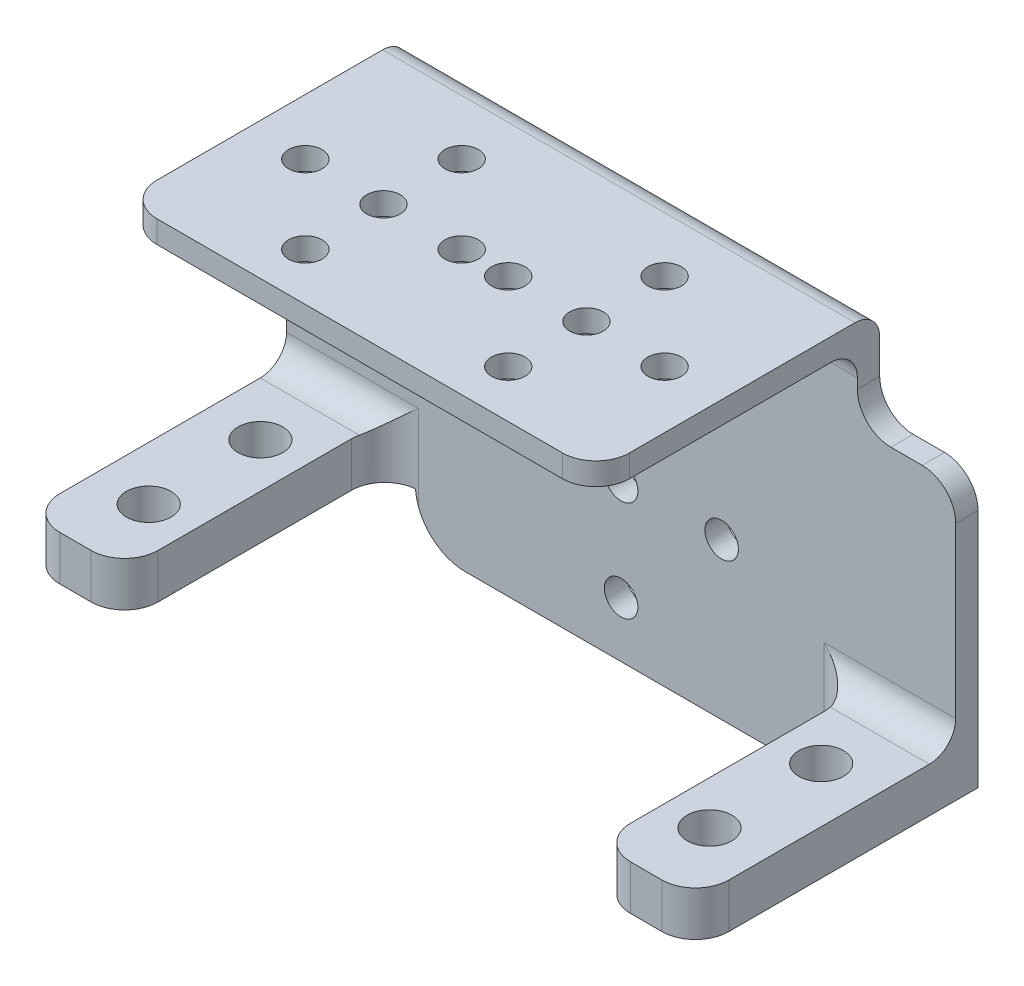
ISO-10303-21;
HEADER;
FILE_DESCRIPTION(('STEP AP214'),'2;1');
FILE_NAME('part.step','',(''),(''),'','','');
FILE_SCHEMA(('AUTOMOTIVE_DESIGN { 1 0 10303 214 1 1 1 1 }'));
ENDSEC;
DATA;
#1=APPLICATION_CONTEXT('core data for automotive mechanical design processes');
#2=APPLICATION_PROTOCOL_DEFINITION('international standard','automotive_design',2000,#1);
#3=PRODUCT_CONTEXT('',#1,'mechanical');
#4=PRODUCT('Part','Part','',(#3));
#5=PRODUCT_RELATED_PRODUCT_CATEGORY('part','',(#4));
#6=PRODUCT_DEFINITION_FORMATION('','',#4);
#7=PRODUCT_DEFINITION_CONTEXT('part definition',#1,'design');
#8=PRODUCT_DEFINITION('design','',#6,#7);
#9=PRODUCT_DEFINITION_SHAPE('','',#8);
#10=(LENGTH_UNIT() NAMED_UNIT(*) SI_UNIT(.MILLI.,.METRE.));
#11=(NAMED_UNIT(*) PLANE_ANGLE_UNIT() SI_UNIT($,.RADIAN.));
#12=(NAMED_UNIT(*) SI_UNIT($,.STERADIAN.) SOLID_ANGLE_UNIT());
#13=UNCERTAINTY_MEASURE_WITH_UNIT(LENGTH_MEASURE(1.E-05),#10,'distance_accuracy_value','');
#14=(GEOMETRIC_REPRESENTATION_CONTEXT(3) GLOBAL_UNCERTAINTY_ASSIGNED_CONTEXT((#13)) GLOBAL_UNIT_ASSIGNED_CONTEXT((#10,
#11,#12)) REPRESENTATION_CONTEXT('',''));
#15=CARTESIAN_POINT('',(0.,0.,0.));
#16=DIRECTION('',(0.,0.,1.));
#17=DIRECTION('',(1.,0.,0.));
#18=AXIS2_PLACEMENT_3D('',#15,#16,#17);
#19=CARTESIAN_POINT('',(0.,16.28,2.2));
#20=DIRECTION('',(-1.,0.,0.));
#21=DIRECTION('',(0.,0.,1.));
#22=AXIS2_PLACEMENT_3D('',#19,#20,#21);
#23=CYLINDRICAL_SURFACE('',#22,2.2);
#24=DIRECTION('',(1.,0.,0.));
#25=VECTOR('',#24,1.);
#26=CARTESIAN_POINT('',(0.,16.28,0.));
#27=LINE('',#26,#25);
#28=CARTESIAN_POINT('',(-21.15,16.28,0.));
#29=VERTEX_POINT('',#28);
#30=CARTESIAN_POINT('',(21.15,16.28,0.));
#31=VERTEX_POINT('',#30);
#32=EDGE_CURVE('E443',#29,#31,#27,.T.);
#33=ORIENTED_EDGE('',*,*,#32,.F.);
#34=CARTESIAN_POINT('',(-21.15,16.28,2.2));
#35=DIRECTION('',(1.,0.,0.));
#36=DIRECTION('',(0.,0.,-1.));
#37=AXIS2_PLACEMENT_3D('',#34,#35,#36);
#38=CIRCLE('',#37,2.2);
#39=CARTESIAN_POINT('',(-21.15,18.48,2.2));
#40=VERTEX_POINT('',#39);
#41=EDGE_CURVE('E449',#40,#29,#38,.F.);
#42=ORIENTED_EDGE('',*,*,#41,.F.);
#43=DIRECTION('',(1.,0.,0.));
#44=VECTOR('',#43,1.);
#45=CARTESIAN_POINT('',(0.,18.48,2.2));
#46=LINE('',#45,#44);
#47=CARTESIAN_POINT('',(21.15,18.48,2.2));
#48=VERTEX_POINT('',#47);
#49=EDGE_CURVE('E446',#48,#40,#46,.F.);
#50=ORIENTED_EDGE('',*,*,#49,.F.);
#51=CARTESIAN_POINT('',(21.15,16.28,2.2));
#52=DIRECTION('',(1.,0.,0.));
#53=DIRECTION('',(0.,1.,0.));
#54=AXIS2_PLACEMENT_3D('',#51,#52,#53);
#55=CIRCLE('',#54,2.2);
#56=EDGE_CURVE('E451',#31,#48,#55,.T.);
#57=ORIENTED_EDGE('',*,*,#56,.F.);
#58=EDGE_LOOP('',(#33,#42,#50,#57));
#59=FACE_BOUND('',#58,.T.);
#60=ADVANCED_FACE('F39',(#59),#23,.T.);
#61=CARTESIAN_POINT('',(0.,-14.28,2.));
#62=DIRECTION('',(0.,1.,0.));
#63=DIRECTION('',(-1.,0.,0.));
#64=AXIS2_PLACEMENT_3D('',#61,#62,#63);
#65=PLANE('',#64);
#66=CARTESIAN_POINT('',(-25.15,-14.28,19.14));
#67=DIRECTION('',(0.,1.,0.));
#68=DIRECTION('',(-1.,0.,0.));
#69=AXIS2_PLACEMENT_3D('',#66,#67,#68);
#70=CIRCLE('',#69,2.);
#71=CARTESIAN_POINT('',(-27.15,-14.28,19.14));
#72=VERTEX_POINT('',#71);
#73=EDGE_CURVE('E458',#72,#72,#70,.T.);
#74=ORIENTED_EDGE('',*,*,#73,.T.);
#75=EDGE_LOOP('',(#74));
#76=FACE_BOUND('',#75,.T.);
#77=CARTESIAN_POINT('',(-25.15,-14.28,9.14));
#78=DIRECTION('',(0.,1.,0.));
#79=DIRECTION('',(-1.,0.,0.));
#80=AXIS2_PLACEMENT_3D('',#77,#78,#79);
#81=CIRCLE('',#80,2.);
#82=CARTESIAN_POINT('',(-27.15,-14.28,9.14));
#83=VERTEX_POINT('',#82);
#84=EDGE_CURVE('E467',#83,#83,#81,.T.);
#85=ORIENTED_EDGE('',*,*,#84,.T.);
#86=EDGE_LOOP('',(#85));
#87=FACE_BOUND('',#86,.T.);
#88=DIRECTION('',(1.,0.,0.));
#89=VECTOR('',#88,1.);
#90=CARTESIAN_POINT('',(0.,-14.28,25.3));
#91=LINE('',#90,#89);
#92=CARTESIAN_POINT('',(-26.95,-14.28,25.3));
#93=VERTEX_POINT('',#92);
#94=CARTESIAN_POINT('',(-24.15,-14.28,25.3));
#95=VERTEX_POINT('',#94);
#96=EDGE_CURVE('E689',#93,#95,#91,.T.);
#97=ORIENTED_EDGE('',*,*,#96,.F.);
#98=CARTESIAN_POINT('',(-26.95,-14.28,22.3));
#99=DIRECTION('',(0.,1.,0.));
#100=DIRECTION('',(-1.,0.,0.));
#101=AXIS2_PLACEMENT_3D('',#98,#99,#100);
#102=CIRCLE('',#101,3.);
#103=CARTESIAN_POINT('',(-29.95,-14.28,22.3));
#104=VERTEX_POINT('',#103);
#105=EDGE_CURVE('E388',#93,#104,#102,.F.);
#106=ORIENTED_EDGE('',*,*,#105,.T.);
#107=DIRECTION('',(0.,0.,-1.));
#108=VECTOR('',#107,1.);
#109=CARTESIAN_POINT('',(-29.95,-14.28,25.3));
#110=LINE('',#109,#108);
#111=CARTESIAN_POINT('',(-29.95,-14.28,0.));
#112=VERTEX_POINT('',#111);
#113=EDGE_CURVE('E655',#104,#112,#110,.T.);
#114=ORIENTED_EDGE('',*,*,#113,.T.);
#115=DIRECTION('',(1.,0.,0.));
#116=VECTOR('',#115,1.);
#117=CARTESIAN_POINT('',(0.,-14.28,0.));
#118=LINE('',#117,#116);
#119=CARTESIAN_POINT('',(-18.3935087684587,-14.28,0.));
#120=VERTEX_POINT('',#119);
#121=EDGE_CURVE('E610',#112,#120,#118,.T.);
#122=ORIENTED_EDGE('',*,*,#121,.T.);
#123=DIRECTION('',(0.,0.,-1.));
#124=VECTOR('',#123,1.);
#125=CARTESIAN_POINT('',(-18.3935087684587,-14.28,2.));
#126=LINE('',#125,#124);
#127=CARTESIAN_POINT('',(-18.3935087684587,-14.28,2.0098990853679));
#128=VERTEX_POINT('',#127);
#129=EDGE_CURVE('E66',#128,#120,#126,.T.);
#130=ORIENTED_EDGE('',*,*,#129,.F.);
#131=CARTESIAN_POINT('',(-18.15,-14.28,5.));
#132=DIRECTION('',(0.,1.,0.));
#133=DIRECTION('',(-1.,0.,0.));
#134=AXIS2_PLACEMENT_3D('',#131,#132,#133);
#135=CIRCLE('',#134,3.);
#136=CARTESIAN_POINT('',(-21.15,-14.28,5.));
#137=VERTEX_POINT('',#136);
#138=EDGE_CURVE('E577',#128,#137,#135,.T.);
#139=ORIENTED_EDGE('',*,*,#138,.T.);
#140=DIRECTION('',(0.,0.,-1.));
#141=VECTOR('',#140,1.);
#142=CARTESIAN_POINT('',(-21.15,-14.28,25.3));
#143=LINE('',#142,#141);
#144=CARTESIAN_POINT('',(-21.15,-14.28,22.3));
#145=VERTEX_POINT('',#144);
#146=EDGE_CURVE('E659',#145,#137,#143,.T.);
#147=ORIENTED_EDGE('',*,*,#146,.F.);
#148=CARTESIAN_POINT('',(-24.15,-14.28,22.3));
#149=DIRECTION('',(0.,1.,0.));
#150=DIRECTION('',(-1.,0.,0.));
#151=AXIS2_PLACEMENT_3D('',#148,#149,#150);
#152=CIRCLE('',#151,3.);
#153=EDGE_CURVE('E386',#145,#95,#152,.F.);
#154=ORIENTED_EDGE('',*,*,#153,.T.);
#155=EDGE_LOOP('',(#97,#106,#114,#122,#130,#139,#147,#154));
#156=FACE_BOUND('',#155,.T.);
#157=ADVANCED_FACE('F508',(#76,#87,#156),#65,.F.);
#158=CARTESIAN_POINT('',(-13.96,-14.04,2.));
#159=DIRECTION('',(0.,0.,-1.));
#160=DIRECTION('',(-1.,0.,0.));
#161=AXIS2_PLACEMENT_3D('',#158,#159,#160);
#162=CYLINDRICAL_SURFACE('',#161,4.44);
#163=CARTESIAN_POINT('',(-13.96,-14.04,0.));
#164=DIRECTION('',(0.,0.,1.));
#165=DIRECTION('',(1.,0.,0.));
#166=AXIS2_PLACEMENT_3D('',#163,#164,#165);
#167=CIRCLE('',#166,4.44);
#168=CARTESIAN_POINT('',(-13.96,-18.48,0.));
#169=VERTEX_POINT('',#168);
#170=EDGE_CURVE('E612',#169,#120,#167,.F.);
#171=ORIENTED_EDGE('',*,*,#170,.F.);
#172=DIRECTION('',(0.,0.,-1.));
#173=VECTOR('',#172,1.);
#174=CARTESIAN_POINT('',(-13.96,-18.48,2.));
#175=LINE('',#174,#173);
#176=CARTESIAN_POINT('',(-13.96,-18.48,2.));
#177=VERTEX_POINT('',#176);
#178=EDGE_CURVE('E329',#177,#169,#175,.T.);
#179=ORIENTED_EDGE('',*,*,#178,.F.);
#180=CARTESIAN_POINT('',(-13.96,-14.04,2.));
#181=DIRECTION('',(0.,0.,1.));
#182=DIRECTION('',(1.,0.,0.));
#183=AXIS2_PLACEMENT_3D('',#180,#181,#182);
#184=CIRCLE('',#183,4.44);
#185=CARTESIAN_POINT('',(-18.15,-15.5088430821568,2.));
#186=VERTEX_POINT('',#185);
#187=EDGE_CURVE('E323',#177,#186,#184,.F.);
#188=ORIENTED_EDGE('',*,*,#187,.T.);
#189=CARTESIAN_POINT('',(-18.15,-15.5088430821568,2.));
#190=CARTESIAN_POINT('',(-18.1847459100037,-15.4097455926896,2.00002282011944));
#191=CARTESIAN_POINT('',(-18.215963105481,-15.3094162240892,2.00060357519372));
#192=CARTESIAN_POINT('',(-18.27107388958,-15.1073074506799,2.00231239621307));
#193=CARTESIAN_POINT('',(-18.2950032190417,-15.005537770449,2.00343771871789));
#194=CARTESIAN_POINT('',(-18.3356210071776,-14.8005634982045,2.00567857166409));
#195=CARTESIAN_POINT('',(-18.3523094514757,-14.6973589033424,2.00679410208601));
#196=CARTESIAN_POINT('',(-18.3784366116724,-14.4895079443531,2.00868775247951));
#197=CARTESIAN_POINT('',(-18.3878385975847,-14.3848569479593,2.00946415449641));
#198=CARTESIAN_POINT('',(-18.3935087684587,-14.28,2.0098990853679));
#199=B_SPLINE_CURVE_WITH_KNOTS('',3,(#189,#190,#191,#192,#193,#194,#195,#196,#197,#198),
.UNSPECIFIED.,.F.,.F.,(4,2,2,2,4),(0.,0.314962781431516,0.628355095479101,0.941748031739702,
1.25671064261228),.UNSPECIFIED.);
#200=EDGE_CURVE('E572',#186,#128,#199,.T.);
#201=ORIENTED_EDGE('',*,*,#200,.T.);
#202=ORIENTED_EDGE('',*,*,#129,.T.);
#203=EDGE_LOOP('',(#171,#179,#188,#201,#202));
#204=FACE_BOUND('',#203,.T.);
#205=ADVANCED_FACE('F565',(#204),#162,.T.);
#206=CARTESIAN_POINT('',(0.,-18.48,2.));
#207=DIRECTION('',(0.,1.,0.));
#208=DIRECTION('',(-1.,0.,0.));
#209=AXIS2_PLACEMENT_3D('',#206,#207,#208);
#210=PLANE('',#209);
#211=DIRECTION('',(1.,0.,0.));
#212=VECTOR('',#211,1.);
#213=CARTESIAN_POINT('',(0.,-18.48,0.));
#214=LINE('',#213,#212);
#215=CARTESIAN_POINT('',(13.96,-18.48,0.));
#216=VERTEX_POINT('',#215);
#217=EDGE_CURVE('E308',#169,#216,#214,.T.);
#218=ORIENTED_EDGE('',*,*,#217,.T.);
#219=DIRECTION('',(0.,0.,-1.));
#220=VECTOR('',#219,1.);
#221=CARTESIAN_POINT('',(13.96,-18.48,2.));
#222=LINE('',#221,#220);
#223=CARTESIAN_POINT('',(13.96,-18.48,2.));
#224=VERTEX_POINT('',#223);
#225=EDGE_CURVE('E325',#224,#216,#222,.T.);
#226=ORIENTED_EDGE('',*,*,#225,.F.);
#227=DIRECTION('',(1.,0.,0.));
#228=VECTOR('',#227,1.);
#229=CARTESIAN_POINT('',(0.,-18.48,2.));
#230=LINE('',#229,#228);
#231=EDGE_CURVE('E626',#177,#224,#230,.T.);
#232=ORIENTED_EDGE('',*,*,#231,.F.);
#233=ORIENTED_EDGE('',*,*,#178,.T.);
#234=EDGE_LOOP('',(#218,#226,#232,#233));
#235=FACE_BOUND('',#234,.T.);
#236=ADVANCED_FACE('F569',(#235),#210,.F.);
#237=CARTESIAN_POINT('',(13.96,-14.04,2.));
#238=DIRECTION('',(0.,0.,-1.));
#239=DIRECTION('',(-1.,0.,0.));
#240=AXIS2_PLACEMENT_3D('',#237,#238,#239);
#241=CYLINDRICAL_SURFACE('',#240,4.44);
#242=CARTESIAN_POINT('',(13.96,-14.04,0.));
#243=DIRECTION('',(0.,0.,1.));
#244=DIRECTION('',(1.,0.,0.));
#245=AXIS2_PLACEMENT_3D('',#242,#243,#244);
#246=CIRCLE('',#245,4.44);
#247=CARTESIAN_POINT('',(18.3935087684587,-14.28,0.));
#248=VERTEX_POINT('',#247);
#249=EDGE_CURVE('E306',#216,#248,#246,.T.);
#250=ORIENTED_EDGE('',*,*,#249,.T.);
#251=DIRECTION('',(0.,0.,-1.));
#252=VECTOR('',#251,1.);
#253=CARTESIAN_POINT('',(18.3935087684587,-14.28,2.));
#254=LINE('',#253,#252);
#255=CARTESIAN_POINT('',(18.3935087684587,-14.28,2.0098990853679));
#256=VERTEX_POINT('',#255);
#257=EDGE_CURVE('E304',#256,#248,#254,.T.);
#258=ORIENTED_EDGE('',*,*,#257,.F.);
#259=CARTESIAN_POINT('',(18.3935087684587,-14.28,2.0098990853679));
#260=CARTESIAN_POINT('',(18.3878385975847,-14.3848569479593,2.00946415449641));
#261=CARTESIAN_POINT('',(18.3784366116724,-14.4895079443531,2.00868775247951));
#262=CARTESIAN_POINT('',(18.3523094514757,-14.6973589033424,2.00679410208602));
#263=CARTESIAN_POINT('',(18.3356210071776,-14.8005634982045,2.00567857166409));
#264=CARTESIAN_POINT('',(18.2950032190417,-15.005537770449,2.00343771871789));
#265=CARTESIAN_POINT('',(18.27107388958,-15.1073074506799,2.00231239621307));
#266=CARTESIAN_POINT('',(18.215963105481,-15.3094162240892,2.00060357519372));
#267=CARTESIAN_POINT('',(18.1847459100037,-15.4097455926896,2.00002282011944));
#268=CARTESIAN_POINT('',(18.15,-15.5088430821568,2.));
#269=B_SPLINE_CURVE_WITH_KNOTS('',3,(#259,#260,#261,#262,#263,#264,#265,#266,#267,#268),
.UNSPECIFIED.,.F.,.F.,(4,2,2,2,4),(0.,0.314962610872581,0.628355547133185,0.941747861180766,
1.25671064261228),.UNSPECIFIED.);
#270=CARTESIAN_POINT('',(18.15,-15.5088430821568,2.));
#271=VERTEX_POINT('',#270);
#272=EDGE_CURVE('E483',#256,#271,#269,.T.);
#273=ORIENTED_EDGE('',*,*,#272,.T.);
#274=CARTESIAN_POINT('',(13.96,-14.04,2.));
#275=DIRECTION('',(0.,0.,1.));
#276=DIRECTION('',(1.,0.,0.));
#277=AXIS2_PLACEMENT_3D('',#274,#275,#276);
#278=CIRCLE('',#277,4.44);
#279=EDGE_CURVE('E622',#224,#271,#278,.T.);
#280=ORIENTED_EDGE('',*,*,#279,.F.);
#281=ORIENTED_EDGE('',*,*,#225,.T.);
#282=EDGE_LOOP('',(#250,#258,#273,#280,#281));
#283=FACE_BOUND('',#282,.T.);
#284=ADVANCED_FACE('F495',(#283),#241,.T.);
#285=CARTESIAN_POINT('',(0.,-14.28,2.));
#286=DIRECTION('',(0.,-1.,0.));
#287=DIRECTION('',(0.,0.,-1.));
#288=AXIS2_PLACEMENT_3D('',#285,#286,#287);
#289=PLANE('',#288);
#290=CARTESIAN_POINT('',(25.05,-14.28,9.14));
#291=DIRECTION('',(0.,-1.,0.));
#292=DIRECTION('',(0.,0.,-1.));
#293=AXIS2_PLACEMENT_3D('',#290,#291,#292);
#294=CIRCLE('',#293,2.);
#295=CARTESIAN_POINT('',(25.05,-14.28,7.14));
#296=VERTEX_POINT('',#295);
#297=EDGE_CURVE('E462',#296,#296,#294,.T.);
#298=ORIENTED_EDGE('',*,*,#297,.F.);
#299=EDGE_LOOP('',(#298));
#300=FACE_BOUND('',#299,.T.);
#301=CARTESIAN_POINT('',(25.05,-14.28,19.14));
#302=DIRECTION('',(0.,-1.,0.));
#303=DIRECTION('',(0.,0.,-1.));
#304=AXIS2_PLACEMENT_3D('',#301,#302,#303);
#305=CIRCLE('',#304,2.);
#306=CARTESIAN_POINT('',(25.05,-14.28,17.14));
#307=VERTEX_POINT('',#306);
#308=EDGE_CURVE('E457',#307,#307,#305,.T.);
#309=ORIENTED_EDGE('',*,*,#308,.F.);
#310=EDGE_LOOP('',(#309));
#311=FACE_BOUND('',#310,.T.);
#312=DIRECTION('',(1.,0.,0.));
#313=VECTOR('',#312,1.);
#314=CARTESIAN_POINT('',(0.,-14.28,25.3));
#315=LINE('',#314,#313);
#316=CARTESIAN_POINT('',(24.15,-14.28,25.3));
#317=VERTEX_POINT('',#316);
#318=CARTESIAN_POINT('',(26.95,-14.28,25.3));
#319=VERTEX_POINT('',#318);
#320=EDGE_CURVE('E706',#317,#319,#315,.T.);
#321=ORIENTED_EDGE('',*,*,#320,.F.);
#322=CARTESIAN_POINT('',(24.15,-14.28,22.3));
#323=DIRECTION('',(0.,-1.,0.));
#324=DIRECTION('',(0.,0.,-1.));
#325=AXIS2_PLACEMENT_3D('',#322,#323,#324);
#326=CIRCLE('',#325,3.);
#327=CARTESIAN_POINT('',(21.15,-14.28,22.3));
#328=VERTEX_POINT('',#327);
#329=EDGE_CURVE('E404',#317,#328,#326,.T.);
#330=ORIENTED_EDGE('',*,*,#329,.T.);
#331=DIRECTION('',(0.,0.,-1.));
#332=VECTOR('',#331,1.);
#333=CARTESIAN_POINT('',(21.15,-14.28,25.3));
#334=LINE('',#333,#332);
#335=CARTESIAN_POINT('',(21.15,-14.28,5.));
#336=VERTEX_POINT('',#335);
#337=EDGE_CURVE('E288',#328,#336,#334,.T.);
#338=ORIENTED_EDGE('',*,*,#337,.T.);
#339=CARTESIAN_POINT('',(18.15,-14.28,5.));
#340=DIRECTION('',(0.,-1.,0.));
#341=DIRECTION('',(0.,0.,-1.));
#342=AXIS2_PLACEMENT_3D('',#339,#340,#341);
#343=CIRCLE('',#342,3.);
#344=EDGE_CURVE('E481',#336,#256,#343,.F.);
#345=ORIENTED_EDGE('',*,*,#344,.T.);
#346=ORIENTED_EDGE('',*,*,#257,.T.);
#347=DIRECTION('',(-1.,0.,0.));
#348=VECTOR('',#347,1.);
#349=CARTESIAN_POINT('',(0.,-14.28,0.));
#350=LINE('',#349,#348);
#351=CARTESIAN_POINT('',(29.95,-14.28,0.));
#352=VERTEX_POINT('',#351);
#353=EDGE_CURVE('E296',#352,#248,#350,.T.);
#354=ORIENTED_EDGE('',*,*,#353,.F.);
#355=DIRECTION('',(0.,0.,-1.));
#356=VECTOR('',#355,1.);
#357=CARTESIAN_POINT('',(29.95,-14.28,25.3));
#358=LINE('',#357,#356);
#359=CARTESIAN_POINT('',(29.95,-14.28,22.3));
#360=VERTEX_POINT('',#359);
#361=EDGE_CURVE('E278',#360,#352,#358,.T.);
#362=ORIENTED_EDGE('',*,*,#361,.F.);
#363=CARTESIAN_POINT('',(26.95,-14.28,22.3));
#364=DIRECTION('',(0.,-1.,0.));
#365=DIRECTION('',(0.,0.,-1.));
#366=AXIS2_PLACEMENT_3D('',#363,#364,#365);
#367=CIRCLE('',#366,3.);
#368=EDGE_CURVE('E402',#360,#319,#367,.T.);
#369=ORIENTED_EDGE('',*,*,#368,.T.);
#370=EDGE_LOOP('',(#321,#330,#338,#345,#346,#354,#362,#369));
#371=FACE_BOUND('',#370,.T.);
#372=ADVANCED_FACE('F302',(#300,#311,#371),#289,.T.);
#373=CARTESIAN_POINT('',(29.95,0.,2.));
#374=DIRECTION('',(1.,0.,0.));
#375=DIRECTION('',(0.,0.,-1.));
#376=AXIS2_PLACEMENT_3D('',#373,#374,#375);
#377=PLANE('',#376);
#378=DIRECTION('',(0.,-1.,0.));
#379=VECTOR('',#378,1.);
#380=CARTESIAN_POINT('',(29.95,0.,0.));
#381=LINE('',#380,#379);
#382=CARTESIAN_POINT('',(29.95,7.22,0.));
#383=VERTEX_POINT('',#382);
#384=EDGE_CURVE('E281',#383,#352,#381,.T.);
#385=ORIENTED_EDGE('',*,*,#384,.F.);
#386=DIRECTION('',(0.,0.,-1.));
#387=VECTOR('',#386,1.);
#388=CARTESIAN_POINT('',(29.95,7.22,2.));
#389=LINE('',#388,#387);
#390=CARTESIAN_POINT('',(29.95,7.22,2.));
#391=VERTEX_POINT('',#390);
#392=EDGE_CURVE('E366',#383,#391,#389,.F.);
#393=ORIENTED_EDGE('',*,*,#392,.T.);
#394=DIRECTION('',(0.,-1.,0.));
#395=VECTOR('',#394,1.);
#396=CARTESIAN_POINT('',(29.95,0.,2.));
#397=LINE('',#396,#395);
#398=CARTESIAN_POINT('',(29.95,-7.92,2.));
#399=VERTEX_POINT('',#398);
#400=EDGE_CURVE('E625',#391,#399,#397,.T.);
#401=ORIENTED_EDGE('',*,*,#400,.T.);
#402=CARTESIAN_POINT('',(29.95,-7.92,4.36));
#403=DIRECTION('',(1.,0.,0.));
#404=DIRECTION('',(0.,0.,-1.));
#405=AXIS2_PLACEMENT_3D('',#402,#403,#404);
#406=CIRCLE('',#405,2.36);
#407=CARTESIAN_POINT('',(29.95,-10.28,4.36));
#408=VERTEX_POINT('',#407);
#409=EDGE_CURVE('E435',#399,#408,#406,.F.);
#410=ORIENTED_EDGE('',*,*,#409,.T.);
#411=DIRECTION('',(0.,0.,-1.));
#412=VECTOR('',#411,1.);
#413=CARTESIAN_POINT('',(29.95,-10.28,25.3));
#414=LINE('',#413,#412);
#415=CARTESIAN_POINT('',(29.95,-10.28,22.3));
#416=VERTEX_POINT('',#415);
#417=EDGE_CURVE('E289',#416,#408,#414,.T.);
#418=ORIENTED_EDGE('',*,*,#417,.F.);
#419=DIRECTION('',(0.,-1.,0.));
#420=VECTOR('',#419,1.);
#421=CARTESIAN_POINT('',(29.95,0.,22.3));
#422=LINE('',#421,#420);
#423=EDGE_CURVE('E285',#416,#360,#422,.T.);
#424=ORIENTED_EDGE('',*,*,#423,.T.);
#425=ORIENTED_EDGE('',*,*,#361,.T.);
#426=EDGE_LOOP('',(#385,#393,#401,#410,#418,#424,#425));
#427=FACE_BOUND('',#426,.T.);
#428=ADVANCED_FACE('F280',(#427),#377,.T.);
#429=CARTESIAN_POINT('',(0.,10.22,2.));
#430=DIRECTION('',(0.,1.,0.));
#431=DIRECTION('',(0.,0.,1.));
#432=AXIS2_PLACEMENT_3D('',#429,#430,#431);
#433=PLANE('',#432);
#434=DIRECTION('',(1.,0.,0.));
#435=VECTOR('',#434,1.);
#436=CARTESIAN_POINT('',(0.,10.22,0.));
#437=LINE('',#436,#435);
#438=CARTESIAN_POINT('',(24.15,10.22,0.));
#439=VERTEX_POINT('',#438);
#440=CARTESIAN_POINT('',(26.95,10.22,0.));
#441=VERTEX_POINT('',#440);
#442=EDGE_CURVE('E299',#439,#441,#437,.T.);
#443=ORIENTED_EDGE('',*,*,#442,.F.);
#444=DIRECTION('',(0.,0.,-1.));
#445=VECTOR('',#444,1.);
#446=CARTESIAN_POINT('',(24.15,10.22,2.));
#447=LINE('',#446,#445);
#448=CARTESIAN_POINT('',(24.15,10.22,2.));
#449=VERTEX_POINT('',#448);
#450=EDGE_CURVE('E363',#439,#449,#447,.F.);
#451=ORIENTED_EDGE('',*,*,#450,.T.);
#452=DIRECTION('',(1.,0.,0.));
#453=VECTOR('',#452,1.);
#454=CARTESIAN_POINT('',(0.,10.22,2.));
#455=LINE('',#454,#453);
#456=CARTESIAN_POINT('',(26.95,10.22,2.));
#457=VERTEX_POINT('',#456);
#458=EDGE_CURVE('E629',#449,#457,#455,.T.);
#459=ORIENTED_EDGE('',*,*,#458,.T.);
#460=DIRECTION('',(0.,0.,-1.));
#461=VECTOR('',#460,1.);
#462=CARTESIAN_POINT('',(26.95,10.22,2.));
#463=LINE('',#462,#461);
#464=EDGE_CURVE('E360',#457,#441,#463,.T.);
#465=ORIENTED_EDGE('',*,*,#464,.T.);
#466=EDGE_LOOP('',(#443,#451,#459,#465));
#467=FACE_BOUND('',#466,.T.);
#468=ADVANCED_FACE('F932',(#467),#433,.T.);
#469=CARTESIAN_POINT('',(21.15,0.,2.));
#470=DIRECTION('',(1.,0.,0.));
#471=DIRECTION('',(0.,1.,0.));
#472=AXIS2_PLACEMENT_3D('',#469,#470,#471);
#473=PLANE('',#472);
#474=DIRECTION('',(0.,-1.,0.));
#475=VECTOR('',#474,1.);
#476=CARTESIAN_POINT('',(21.15,0.,0.));
#477=LINE('',#476,#475);
#478=CARTESIAN_POINT('',(21.15,13.22,0.));
#479=VERTEX_POINT('',#478);
#480=EDGE_CURVE('E312',#31,#479,#477,.T.);
#481=ORIENTED_EDGE('',*,*,#480,.F.);
#482=ORIENTED_EDGE('',*,*,#56,.T.);
#483=DIRECTION('',(0.,0.,-1.));
#484=VECTOR('',#483,1.);
#485=CARTESIAN_POINT('',(21.15,18.48,25.4));
#486=LINE('',#485,#484);
#487=CARTESIAN_POINT('',(21.15,18.48,22.4));
#488=VERTEX_POINT('',#487);
#489=EDGE_CURVE('E613',#488,#48,#486,.T.);
#490=ORIENTED_EDGE('',*,*,#489,.F.);
#491=DIRECTION('',(0.,-1.,0.));
#492=VECTOR('',#491,1.);
#493=CARTESIAN_POINT('',(21.15,0.,22.4));
#494=LINE('',#493,#492);
#495=CARTESIAN_POINT('',(21.15,16.48,22.4));
#496=VERTEX_POINT('',#495);
#497=EDGE_CURVE('E354',#488,#496,#494,.T.);
#498=ORIENTED_EDGE('',*,*,#497,.T.);
#499=DIRECTION('',(0.,0.,-1.));
#500=VECTOR('',#499,1.);
#501=CARTESIAN_POINT('',(21.15,16.48,25.4));
#502=LINE('',#501,#500);
#503=CARTESIAN_POINT('',(21.15,16.48,4.36));
#504=VERTEX_POINT('',#503);
#505=EDGE_CURVE('E672',#496,#504,#502,.T.);
#506=ORIENTED_EDGE('',*,*,#505,.T.);
#507=CARTESIAN_POINT('',(21.15,14.12,4.36));
#508=DIRECTION('',(1.,0.,0.));
#509=DIRECTION('',(0.,1.,0.));
#510=AXIS2_PLACEMENT_3D('',#507,#508,#509);
#511=CIRCLE('',#510,2.36);
#512=CARTESIAN_POINT('',(21.15,14.12,2.));
#513=VERTEX_POINT('',#512);
#514=EDGE_CURVE('E439',#504,#513,#511,.F.);
#515=ORIENTED_EDGE('',*,*,#514,.T.);
#516=DIRECTION('',(0.,-1.,0.));
#517=VECTOR('',#516,1.);
#518=CARTESIAN_POINT('',(21.15,0.,2.));
#519=LINE('',#518,#517);
#520=CARTESIAN_POINT('',(21.15,13.22,2.));
#521=VERTEX_POINT('',#520);
#522=EDGE_CURVE('E634',#513,#521,#519,.T.);
#523=ORIENTED_EDGE('',*,*,#522,.T.);
#524=DIRECTION('',(0.,0.,-1.));
#525=VECTOR('',#524,1.);
#526=CARTESIAN_POINT('',(21.15,13.22,0.));
#527=LINE('',#526,#525);
#528=EDGE_CURVE('E357',#521,#479,#527,.T.);
#529=ORIENTED_EDGE('',*,*,#528,.T.);
#530=EDGE_LOOP('',(#481,#482,#490,#498,#506,#515,#523,#529));
#531=FACE_BOUND('',#530,.T.);
#532=ADVANCED_FACE('F925',(#531),#473,.T.);
#533=CARTESIAN_POINT('',(-21.15,0.,2.));
#534=DIRECTION('',(1.,0.,0.));
#535=DIRECTION('',(0.,0.,-1.));
#536=AXIS2_PLACEMENT_3D('',#533,#534,#535);
#537=PLANE('',#536);
#538=DIRECTION('',(0.,0.,-1.));
#539=VECTOR('',#538,1.);
#540=CARTESIAN_POINT('',(-21.15,18.48,25.4));
#541=LINE('',#540,#539);
#542=CARTESIAN_POINT('',(-21.15,18.48,22.4));
#543=VERTEX_POINT('',#542);
#544=EDGE_CURVE('E678',#543,#40,#541,.T.);
#545=ORIENTED_EDGE('',*,*,#544,.T.);
#546=ORIENTED_EDGE('',*,*,#41,.T.);
#547=DIRECTION('',(0.,-1.,0.));
#548=VECTOR('',#547,1.);
#549=CARTESIAN_POINT('',(-21.15,0.,0.));
#550=LINE('',#549,#548);
#551=CARTESIAN_POINT('',(-21.15,13.22,0.));
#552=VERTEX_POINT('',#551);
#553=EDGE_CURVE('E313',#29,#552,#550,.T.);
#554=ORIENTED_EDGE('',*,*,#553,.T.);
#555=DIRECTION('',(0.,0.,-1.));
#556=VECTOR('',#555,1.);
#557=CARTESIAN_POINT('',(-21.15,13.22,2.));
#558=LINE('',#557,#556);
#559=CARTESIAN_POINT('',(-21.15,13.22,2.));
#560=VERTEX_POINT('',#559);
#561=EDGE_CURVE('E351',#552,#560,#558,.F.);
#562=ORIENTED_EDGE('',*,*,#561,.T.);
#563=DIRECTION('',(0.,-1.,0.));
#564=VECTOR('',#563,1.);
#565=CARTESIAN_POINT('',(-21.15,0.,2.));
#566=LINE('',#565,#564);
#567=CARTESIAN_POINT('',(-21.15,14.12,2.));
#568=VERTEX_POINT('',#567);
#569=EDGE_CURVE('E606',#568,#560,#566,.T.);
#570=ORIENTED_EDGE('',*,*,#569,.F.);
#571=CARTESIAN_POINT('',(-21.15,14.12,4.36));
#572=DIRECTION('',(1.,0.,0.));
#573=DIRECTION('',(0.,0.,-1.));
#574=AXIS2_PLACEMENT_3D('',#571,#572,#573);
#575=CIRCLE('',#574,2.36);
#576=CARTESIAN_POINT('',(-21.15,16.48,4.36));
#577=VERTEX_POINT('',#576);
#578=EDGE_CURVE('E441',#568,#577,#575,.T.);
#579=ORIENTED_EDGE('',*,*,#578,.T.);
#580=DIRECTION('',(0.,0.,-1.));
#581=VECTOR('',#580,1.);
#582=CARTESIAN_POINT('',(-21.15,16.48,25.4));
#583=LINE('',#582,#581);
#584=CARTESIAN_POINT('',(-21.15,16.48,22.4));
#585=VERTEX_POINT('',#584);
#586=EDGE_CURVE('E675',#585,#577,#583,.T.);
#587=ORIENTED_EDGE('',*,*,#586,.F.);
#588=DIRECTION('',(0.,-1.,0.));
#589=VECTOR('',#588,1.);
#590=CARTESIAN_POINT('',(-21.15,18.48,22.4));
#591=LINE('',#590,#589);
#592=EDGE_CURVE('E349',#585,#543,#591,.F.);
#593=ORIENTED_EDGE('',*,*,#592,.T.);
#594=EDGE_LOOP('',(#545,#546,#554,#562,#570,#579,#587,#593));
#595=FACE_BOUND('',#594,.T.);
#596=ADVANCED_FACE('F645',(#595),#537,.F.);
#597=CARTESIAN_POINT('',(0.,10.22,2.));
#598=DIRECTION('',(0.,1.,0.));
#599=DIRECTION('',(0.,0.,1.));
#600=AXIS2_PLACEMENT_3D('',#597,#598,#599);
#601=PLANE('',#600);
#602=DIRECTION('',(1.,0.,0.));
#603=VECTOR('',#602,1.);
#604=CARTESIAN_POINT('',(0.,10.22,0.));
#605=LINE('',#604,#603);
#606=CARTESIAN_POINT('',(-26.95,10.22,0.));
#607=VERTEX_POINT('',#606);
#608=CARTESIAN_POINT('',(-24.15,10.22,0.));
#609=VERTEX_POINT('',#608);
#610=EDGE_CURVE('E317',#607,#609,#605,.T.);
#611=ORIENTED_EDGE('',*,*,#610,.F.);
#612=DIRECTION('',(0.,0.,-1.));
#613=VECTOR('',#612,1.);
#614=CARTESIAN_POINT('',(-26.95,10.22,2.));
#615=LINE('',#614,#613);
#616=CARTESIAN_POINT('',(-26.95,10.22,2.));
#617=VERTEX_POINT('',#616);
#618=EDGE_CURVE('E343',#607,#617,#615,.F.);
#619=ORIENTED_EDGE('',*,*,#618,.T.);
#620=DIRECTION('',(1.,0.,0.));
#621=VECTOR('',#620,1.);
#622=CARTESIAN_POINT('',(0.,10.22,2.));
#623=LINE('',#622,#621);
#624=CARTESIAN_POINT('',(-24.15,10.22,2.));
#625=VERTEX_POINT('',#624);
#626=EDGE_CURVE('E603',#617,#625,#623,.T.);
#627=ORIENTED_EDGE('',*,*,#626,.T.);
#628=DIRECTION('',(0.,0.,-1.));
#629=VECTOR('',#628,1.);
#630=CARTESIAN_POINT('',(-24.15,10.22,2.));
#631=LINE('',#630,#629);
#632=EDGE_CURVE('E340',#625,#609,#631,.T.);
#633=ORIENTED_EDGE('',*,*,#632,.T.);
#634=EDGE_LOOP('',(#611,#619,#627,#633));
#635=FACE_BOUND('',#634,.T.);
#636=ADVANCED_FACE('F649',(#635),#601,.T.);
#637=CARTESIAN_POINT('',(-29.95,0.,2.));
#638=DIRECTION('',(1.,0.,0.));
#639=DIRECTION('',(0.,1.,0.));
#640=AXIS2_PLACEMENT_3D('',#637,#638,#639);
#641=PLANE('',#640);
#642=DIRECTION('',(0.,-1.,0.));
#643=VECTOR('',#642,1.);
#644=CARTESIAN_POINT('',(-29.95,0.,2.));
#645=LINE('',#644,#643);
#646=CARTESIAN_POINT('',(-29.95,7.22,2.));
#647=VERTEX_POINT('',#646);
#648=CARTESIAN_POINT('',(-29.95,-7.92,2.));
#649=VERTEX_POINT('',#648);
#650=EDGE_CURVE('E326',#647,#649,#645,.T.);
#651=ORIENTED_EDGE('',*,*,#650,.F.);
#652=DIRECTION('',(0.,0.,-1.));
#653=VECTOR('',#652,1.);
#654=CARTESIAN_POINT('',(-29.95,7.22,0.));
#655=LINE('',#654,#653);
#656=CARTESIAN_POINT('',(-29.95,7.22,0.));
#657=VERTEX_POINT('',#656);
#658=EDGE_CURVE('E334',#647,#657,#655,.T.);
#659=ORIENTED_EDGE('',*,*,#658,.T.);
#660=DIRECTION('',(0.,-1.,0.));
#661=VECTOR('',#660,1.);
#662=CARTESIAN_POINT('',(-29.95,0.,0.));
#663=LINE('',#662,#661);
#664=EDGE_CURVE('E320',#657,#112,#663,.T.);
#665=ORIENTED_EDGE('',*,*,#664,.T.);
#666=ORIENTED_EDGE('',*,*,#113,.F.);
#667=DIRECTION('',(0.,-1.,0.));
#668=VECTOR('',#667,1.);
#669=CARTESIAN_POINT('',(-29.95,-10.28,22.3));
#670=LINE('',#669,#668);
#671=CARTESIAN_POINT('',(-29.95,-10.28,22.3));
#672=VERTEX_POINT('',#671);
#673=EDGE_CURVE('E332',#104,#672,#670,.F.);
#674=ORIENTED_EDGE('',*,*,#673,.T.);
#675=DIRECTION('',(0.,0.,-1.));
#676=VECTOR('',#675,1.);
#677=CARTESIAN_POINT('',(-29.95,-10.28,25.3));
#678=LINE('',#677,#676);
#679=CARTESIAN_POINT('',(-29.95,-10.28,4.36));
#680=VERTEX_POINT('',#679);
#681=EDGE_CURVE('E658',#672,#680,#678,.T.);
#682=ORIENTED_EDGE('',*,*,#681,.T.);
#683=CARTESIAN_POINT('',(-29.95,-7.92,4.36));
#684=DIRECTION('',(1.,0.,0.));
#685=DIRECTION('',(0.,1.,0.));
#686=AXIS2_PLACEMENT_3D('',#683,#684,#685);
#687=CIRCLE('',#686,2.36);
#688=EDGE_CURVE('E437',#680,#649,#687,.T.);
#689=ORIENTED_EDGE('',*,*,#688,.T.);
#690=EDGE_LOOP('',(#651,#659,#665,#666,#674,#682,#689));
#691=FACE_BOUND('',#690,.T.);
#692=ADVANCED_FACE('F653',(#691),#641,.F.);
#693=CARTESIAN_POINT('',(0.,0.,2.));
#694=DIRECTION('',(0.,0.,1.));
#695=DIRECTION('',(1.,0.,0.));
#696=AXIS2_PLACEMENT_3D('',#693,#694,#695);
#697=PLANE('',#696);
#698=CARTESIAN_POINT('',(0.,-4.52,2.));
#699=DIRECTION('',(0.,0.,1.));
#700=DIRECTION('',(1.,0.,0.));
#701=AXIS2_PLACEMENT_3D('',#698,#699,#700);
#702=CIRCLE('',#701,1.5);
#703=CARTESIAN_POINT('',(1.5,-4.52,2.));
#704=VERTEX_POINT('',#703);
#705=EDGE_CURVE('E785',#704,#704,#702,.T.);
#706=ORIENTED_EDGE('',*,*,#705,.F.);
#707=EDGE_LOOP('',(#706));
#708=FACE_BOUND('',#707,.T.);
#709=CARTESIAN_POINT('',(0.,-13.52,2.));
#710=DIRECTION('',(0.,0.,1.));
#711=DIRECTION('',(1.,0.,0.));
#712=AXIS2_PLACEMENT_3D('',#709,#710,#711);
#713=CIRCLE('',#712,1.5);
#714=CARTESIAN_POINT('',(1.5,-13.52,2.));
#715=VERTEX_POINT('',#714);
#716=EDGE_CURVE('E788',#715,#715,#713,.T.);
#717=ORIENTED_EDGE('',*,*,#716,.F.);
#718=EDGE_LOOP('',(#717));
#719=FACE_BOUND('',#718,.T.);
#720=CARTESIAN_POINT('',(-9.,-4.52,2.));
#721=DIRECTION('',(0.,0.,1.));
#722=DIRECTION('',(1.,0.,0.));
#723=AXIS2_PLACEMENT_3D('',#720,#721,#722);
#724=CIRCLE('',#723,1.5);
#725=CARTESIAN_POINT('',(-7.5,-4.52,2.));
#726=VERTEX_POINT('',#725);
#727=EDGE_CURVE('E791',#726,#726,#724,.T.);
#728=ORIENTED_EDGE('',*,*,#727,.F.);
#729=EDGE_LOOP('',(#728));
#730=FACE_BOUND('',#729,.T.);
#731=CARTESIAN_POINT('',(0.,4.48,2.));
#732=DIRECTION('',(0.,0.,1.));
#733=DIRECTION('',(1.,0.,0.));
#734=AXIS2_PLACEMENT_3D('',#731,#732,#733);
#735=CIRCLE('',#734,1.5);
#736=CARTESIAN_POINT('',(1.5,4.48,2.));
#737=VERTEX_POINT('',#736);
#738=EDGE_CURVE('E794',#737,#737,#735,.T.);
#739=ORIENTED_EDGE('',*,*,#738,.F.);
#740=EDGE_LOOP('',(#739));
#741=FACE_BOUND('',#740,.T.);
#742=CARTESIAN_POINT('',(9.,-4.52,2.));
#743=DIRECTION('',(0.,0.,1.));
#744=DIRECTION('',(1.,0.,0.));
#745=AXIS2_PLACEMENT_3D('',#742,#743,#744);
#746=CIRCLE('',#745,1.5);
#747=CARTESIAN_POINT('',(10.5,-4.52,2.));
#748=VERTEX_POINT('',#747);
#749=EDGE_CURVE('E775',#748,#748,#746,.T.);
#750=ORIENTED_EDGE('',*,*,#749,.F.);
#751=EDGE_LOOP('',(#750));
#752=FACE_BOUND('',#751,.T.);
#753=ORIENTED_EDGE('',*,*,#279,.T.);
#754=DIRECTION('',(0.,-1.,0.));
#755=VECTOR('',#754,1.);
#756=CARTESIAN_POINT('',(18.15,0.,2.));
#757=LINE('',#756,#755);
#758=CARTESIAN_POINT('',(18.15,-7.92,2.));
#759=VERTEX_POINT('',#758);
#760=EDGE_CURVE('E476',#271,#759,#757,.F.);
#761=ORIENTED_EDGE('',*,*,#760,.T.);
#762=DIRECTION('',(1.,0.,0.));
#763=VECTOR('',#762,1.);
#764=CARTESIAN_POINT('',(29.95,-7.92,2.));
#765=LINE('',#764,#763);
#766=EDGE_CURVE('E426',#759,#399,#765,.T.);
#767=ORIENTED_EDGE('',*,*,#766,.T.);
#768=ORIENTED_EDGE('',*,*,#400,.F.);
#769=CARTESIAN_POINT('',(26.95,7.22,2.));
#770=DIRECTION('',(0.,0.,1.));
#771=DIRECTION('',(1.,0.,0.));
#772=AXIS2_PLACEMENT_3D('',#769,#770,#771);
#773=CIRCLE('',#772,3.);
#774=EDGE_CURVE('E345',#391,#457,#773,.T.);
#775=ORIENTED_EDGE('',*,*,#774,.T.);
#776=ORIENTED_EDGE('',*,*,#458,.F.);
#777=CARTESIAN_POINT('',(24.15,13.22,2.));
#778=DIRECTION('',(0.,0.,1.));
#779=DIRECTION('',(1.,0.,0.));
#780=AXIS2_PLACEMENT_3D('',#777,#778,#779);
#781=CIRCLE('',#780,3.);
#782=EDGE_CURVE('E419',#449,#521,#781,.F.);
#783=ORIENTED_EDGE('',*,*,#782,.T.);
#784=ORIENTED_EDGE('',*,*,#522,.F.);
#785=DIRECTION('',(1.,0.,0.));
#786=VECTOR('',#785,1.);
#787=CARTESIAN_POINT('',(0.,14.12,2.));
#788=LINE('',#787,#786);
#789=EDGE_CURVE('E422',#513,#568,#788,.F.);
#790=ORIENTED_EDGE('',*,*,#789,.T.);
#791=ORIENTED_EDGE('',*,*,#569,.T.);
#792=CARTESIAN_POINT('',(-24.15,13.22,2.));
#793=DIRECTION('',(0.,0.,1.));
#794=DIRECTION('',(1.,0.,0.));
#795=AXIS2_PLACEMENT_3D('',#792,#793,#794);
#796=CIRCLE('',#795,3.);
#797=EDGE_CURVE('E415',#560,#625,#796,.F.);
#798=ORIENTED_EDGE('',*,*,#797,.T.);
#799=ORIENTED_EDGE('',*,*,#626,.F.);
#800=CARTESIAN_POINT('',(-26.95,7.22,2.));
#801=DIRECTION('',(0.,0.,1.));
#802=DIRECTION('',(1.,0.,0.));
#803=AXIS2_PLACEMENT_3D('',#800,#801,#802);
#804=CIRCLE('',#803,3.);
#805=EDGE_CURVE('E347',#617,#647,#804,.T.);
#806=ORIENTED_EDGE('',*,*,#805,.T.);
#807=ORIENTED_EDGE('',*,*,#650,.T.);
#808=DIRECTION('',(1.,0.,0.));
#809=VECTOR('',#808,1.);
#810=CARTESIAN_POINT('',(-21.15,-7.92,2.));
#811=LINE('',#810,#809);
#812=CARTESIAN_POINT('',(-18.15,-7.92,2.));
#813=VERTEX_POINT('',#812);
#814=EDGE_CURVE('E424',#649,#813,#811,.T.);
#815=ORIENTED_EDGE('',*,*,#814,.T.);
#816=DIRECTION('',(0.,-1.,0.));
#817=VECTOR('',#816,1.);
#818=CARTESIAN_POINT('',(-18.15,-14.28,2.));
#819=LINE('',#818,#817);
#820=EDGE_CURVE('E473',#813,#186,#819,.T.);
#821=ORIENTED_EDGE('',*,*,#820,.T.);
#822=ORIENTED_EDGE('',*,*,#187,.F.);
#823=ORIENTED_EDGE('',*,*,#231,.T.);
#824=EDGE_LOOP('',(#753,#761,#767,#768,#775,#776,#783,#784,#790,#791,#798,#799,#806,#807,#815,
#821,#822,#823));
#825=FACE_BOUND('',#824,.T.);
#826=ADVANCED_FACE('F595',(#708,#719,#730,#741,#752,#825),#697,.T.);
#827=CARTESIAN_POINT('',(0.,0.,0.));
#828=DIRECTION('',(0.,0.,1.));
#829=DIRECTION('',(1.,0.,0.));
#830=AXIS2_PLACEMENT_3D('',#827,#828,#829);
#831=PLANE('',#830);
#832=CARTESIAN_POINT('',(0.,-4.52,0.));
#833=DIRECTION('',(0.,0.,-1.));
#834=DIRECTION('',(-1.,0.,0.));
#835=AXIS2_PLACEMENT_3D('',#832,#833,#834);
#836=CIRCLE('',#835,1.5);
#837=CARTESIAN_POINT('',(-1.5,-4.52,0.));
#838=VERTEX_POINT('',#837);
#839=EDGE_CURVE('E804',#838,#838,#836,.T.);
#840=ORIENTED_EDGE('',*,*,#839,.F.);
#841=EDGE_LOOP('',(#840));
#842=FACE_BOUND('',#841,.T.);
#843=CARTESIAN_POINT('',(0.,-13.52,0.));
#844=DIRECTION('',(0.,0.,-1.));
#845=DIRECTION('',(-1.,0.,0.));
#846=AXIS2_PLACEMENT_3D('',#843,#844,#845);
#847=CIRCLE('',#846,1.5);
#848=CARTESIAN_POINT('',(-1.5,-13.52,0.));
#849=VERTEX_POINT('',#848);
#850=EDGE_CURVE('E801',#849,#849,#847,.T.);
#851=ORIENTED_EDGE('',*,*,#850,.F.);
#852=EDGE_LOOP('',(#851));
#853=FACE_BOUND('',#852,.T.);
#854=CARTESIAN_POINT('',(-9.,-4.52,0.));
#855=DIRECTION('',(0.,0.,-1.));
#856=DIRECTION('',(-1.,0.,0.));
#857=AXIS2_PLACEMENT_3D('',#854,#855,#856);
#858=CIRCLE('',#857,1.5);
#859=CARTESIAN_POINT('',(-10.5,-4.52,0.));
#860=VERTEX_POINT('',#859);
#861=EDGE_CURVE('E798',#860,#860,#858,.T.);
#862=ORIENTED_EDGE('',*,*,#861,.F.);
#863=EDGE_LOOP('',(#862));
#864=FACE_BOUND('',#863,.T.);
#865=CARTESIAN_POINT('',(0.,4.48,0.));
#866=DIRECTION('',(0.,0.,-1.));
#867=DIRECTION('',(-1.,0.,0.));
#868=AXIS2_PLACEMENT_3D('',#865,#866,#867);
#869=CIRCLE('',#868,1.5);
#870=CARTESIAN_POINT('',(-1.5,4.48,0.));
#871=VERTEX_POINT('',#870);
#872=EDGE_CURVE('E797',#871,#871,#869,.T.);
#873=ORIENTED_EDGE('',*,*,#872,.F.);
#874=EDGE_LOOP('',(#873));
#875=FACE_BOUND('',#874,.T.);
#876=CARTESIAN_POINT('',(9.,-4.52,0.));
#877=DIRECTION('',(0.,0.,-1.));
#878=DIRECTION('',(-1.,0.,0.));
#879=AXIS2_PLACEMENT_3D('',#876,#877,#878);
#880=CIRCLE('',#879,1.5);
#881=CARTESIAN_POINT('',(7.5,-4.52,0.));
#882=VERTEX_POINT('',#881);
#883=EDGE_CURVE('E782',#882,#882,#880,.T.);
#884=ORIENTED_EDGE('',*,*,#883,.F.);
#885=EDGE_LOOP('',(#884));
#886=FACE_BOUND('',#885,.T.);
#887=ORIENTED_EDGE('',*,*,#553,.F.);
#888=ORIENTED_EDGE('',*,*,#32,.T.);
#889=ORIENTED_EDGE('',*,*,#480,.T.);
#890=CARTESIAN_POINT('',(24.15,13.22,0.));
#891=DIRECTION('',(0.,0.,1.));
#892=DIRECTION('',(1.,0.,0.));
#893=AXIS2_PLACEMENT_3D('',#890,#891,#892);
#894=CIRCLE('',#893,3.);
#895=EDGE_CURVE('E417',#479,#439,#894,.T.);
#896=ORIENTED_EDGE('',*,*,#895,.T.);
#897=ORIENTED_EDGE('',*,*,#442,.T.);
#898=CARTESIAN_POINT('',(26.95,7.22,0.));
#899=DIRECTION('',(0.,0.,1.));
#900=DIRECTION('',(1.,0.,0.));
#901=AXIS2_PLACEMENT_3D('',#898,#899,#900);
#902=CIRCLE('',#901,3.);
#903=EDGE_CURVE('E298',#441,#383,#902,.F.);
#904=ORIENTED_EDGE('',*,*,#903,.T.);
#905=ORIENTED_EDGE('',*,*,#384,.T.);
#906=ORIENTED_EDGE('',*,*,#353,.T.);
#907=ORIENTED_EDGE('',*,*,#249,.F.);
#908=ORIENTED_EDGE('',*,*,#217,.F.);
#909=ORIENTED_EDGE('',*,*,#170,.T.);
#910=ORIENTED_EDGE('',*,*,#121,.F.);
#911=ORIENTED_EDGE('',*,*,#664,.F.);
#912=CARTESIAN_POINT('',(-26.95,7.22,0.));
#913=DIRECTION('',(0.,0.,1.));
#914=DIRECTION('',(1.,0.,0.));
#915=AXIS2_PLACEMENT_3D('',#912,#913,#914);
#916=CIRCLE('',#915,3.);
#917=EDGE_CURVE('E338',#657,#607,#916,.F.);
#918=ORIENTED_EDGE('',*,*,#917,.T.);
#919=ORIENTED_EDGE('',*,*,#610,.T.);
#920=CARTESIAN_POINT('',(-24.15,13.22,0.));
#921=DIRECTION('',(0.,0.,1.));
#922=DIRECTION('',(1.,0.,0.));
#923=AXIS2_PLACEMENT_3D('',#920,#921,#922);
#924=CIRCLE('',#923,3.);
#925=EDGE_CURVE('E412',#609,#552,#924,.T.);
#926=ORIENTED_EDGE('',*,*,#925,.T.);
#927=EDGE_LOOP('',(#887,#888,#889,#896,#897,#904,#905,#906,#907,#908,#909,#910,#911,#918,#919,#926));
#928=FACE_BOUND('',#927,.T.);
#929=ADVANCED_FACE('F294',(#842,#853,#864,#875,#886,#928),#831,.F.);
#930=CARTESIAN_POINT('',(0.,16.48,25.4));
#931=DIRECTION('',(0.,1.,0.));
#932=DIRECTION('',(0.,0.,1.));
#933=AXIS2_PLACEMENT_3D('',#930,#931,#932);
#934=PLANE('',#933);
#935=CARTESIAN_POINT('',(-9.13457567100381,16.48,7.13999999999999));
#936=DIRECTION('',(0.,1.,0.));
#937=DIRECTION('',(0.,0.,1.));
#938=AXIS2_PLACEMENT_3D('',#935,#936,#937);
#939=CIRCLE('',#938,1.5);
#940=CARTESIAN_POINT('',(-9.13457567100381,16.48,8.63999999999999));
#941=VERTEX_POINT('',#940);
#942=EDGE_CURVE('E725',#941,#941,#939,.T.);
#943=ORIENTED_EDGE('',*,*,#942,.T.);
#944=EDGE_LOOP('',(#943));
#945=FACE_BOUND('',#944,.T.);
#946=CARTESIAN_POINT('',(-2.13457567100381,16.48,14.14));
#947=DIRECTION('',(0.,1.,0.));
#948=DIRECTION('',(0.,0.,1.));
#949=AXIS2_PLACEMENT_3D('',#946,#947,#948);
#950=CIRCLE('',#949,1.5);
#951=CARTESIAN_POINT('',(-2.13457567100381,16.48,15.64));
#952=VERTEX_POINT('',#951);
#953=EDGE_CURVE('E728',#952,#952,#950,.T.);
#954=ORIENTED_EDGE('',*,*,#953,.T.);
#955=EDGE_LOOP('',(#954));
#956=FACE_BOUND('',#955,.T.);
#957=CARTESIAN_POINT('',(-9.13457567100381,16.48,21.14));
#958=DIRECTION('',(0.,1.,0.));
#959=DIRECTION('',(0.,0.,1.));
#960=AXIS2_PLACEMENT_3D('',#957,#958,#959);
#961=CIRCLE('',#960,1.5);
#962=CARTESIAN_POINT('',(-9.13457567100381,16.48,22.64));
#963=VERTEX_POINT('',#962);
#964=EDGE_CURVE('E731',#963,#963,#961,.T.);
#965=ORIENTED_EDGE('',*,*,#964,.T.);
#966=EDGE_LOOP('',(#965));
#967=FACE_BOUND('',#966,.T.);
#968=CARTESIAN_POINT('',(-16.1345756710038,16.48,14.14));
#969=DIRECTION('',(0.,1.,0.));
#970=DIRECTION('',(0.,0.,1.));
#971=AXIS2_PLACEMENT_3D('',#968,#969,#970);
#972=CIRCLE('',#971,1.5);
#973=CARTESIAN_POINT('',(-16.1345756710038,16.48,15.64));
#974=VERTEX_POINT('',#973);
#975=EDGE_CURVE('E734',#974,#974,#972,.T.);
#976=ORIENTED_EDGE('',*,*,#975,.T.);
#977=EDGE_LOOP('',(#976));
#978=FACE_BOUND('',#977,.T.);
#979=CARTESIAN_POINT('',(2.03457567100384,16.48,14.14));
#980=DIRECTION('',(0.,1.,0.));
#981=DIRECTION('',(0.,0.,1.));
#982=AXIS2_PLACEMENT_3D('',#979,#980,#981);
#983=CIRCLE('',#982,1.5);
#984=CARTESIAN_POINT('',(2.03457567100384,16.48,15.64));
#985=VERTEX_POINT('',#984);
#986=EDGE_CURVE('E737',#985,#985,#983,.T.);
#987=ORIENTED_EDGE('',*,*,#986,.T.);
#988=EDGE_LOOP('',(#987));
#989=FACE_BOUND('',#988,.T.);
#990=CARTESIAN_POINT('',(9.03457567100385,16.48,7.13999999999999));
#991=DIRECTION('',(0.,1.,0.));
#992=DIRECTION('',(0.,0.,1.));
#993=AXIS2_PLACEMENT_3D('',#990,#991,#992);
#994=CIRCLE('',#993,1.5);
#995=CARTESIAN_POINT('',(9.03457567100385,16.48,8.63999999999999));
#996=VERTEX_POINT('',#995);
#997=EDGE_CURVE('E740',#996,#996,#994,.T.);
#998=ORIENTED_EDGE('',*,*,#997,.T.);
#999=EDGE_LOOP('',(#998));
#1000=FACE_BOUND('',#999,.T.);
#1001=CARTESIAN_POINT('',(16.0345756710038,16.48,14.14));
#1002=DIRECTION('',(0.,1.,0.));
#1003=DIRECTION('',(0.,0.,1.));
#1004=AXIS2_PLACEMENT_3D('',#1001,#1002,#1003);
#1005=CIRCLE('',#1004,1.5);
#1006=CARTESIAN_POINT('',(16.0345756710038,16.48,15.64));
#1007=VERTEX_POINT('',#1006);
#1008=EDGE_CURVE('E743',#1007,#1007,#1005,.T.);
#1009=ORIENTED_EDGE('',*,*,#1008,.T.);
#1010=EDGE_LOOP('',(#1009));
#1011=FACE_BOUND('',#1010,.T.);
#1012=CARTESIAN_POINT('',(9.03457567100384,16.48,21.14));
#1013=DIRECTION('',(0.,1.,0.));
#1014=DIRECTION('',(0.,0.,1.));
#1015=AXIS2_PLACEMENT_3D('',#1012,#1013,#1014);
#1016=CIRCLE('',#1015,1.5);
#1017=CARTESIAN_POINT('',(9.03457567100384,16.48,22.64));
#1018=VERTEX_POINT('',#1017);
#1019=EDGE_CURVE('E746',#1018,#1018,#1016,.T.);
#1020=ORIENTED_EDGE('',*,*,#1019,.T.);
#1021=EDGE_LOOP('',(#1020));
#1022=FACE_BOUND('',#1021,.T.);
#1023=CARTESIAN_POINT('',(-9.13457567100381,16.48,14.14));
#1024=DIRECTION('',(0.,1.,0.));
#1025=DIRECTION('',(0.,0.,1.));
#1026=AXIS2_PLACEMENT_3D('',#1023,#1024,#1025);
#1027=CIRCLE('',#1026,1.5);
#1028=CARTESIAN_POINT('',(-9.13457567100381,16.48,15.64));
#1029=VERTEX_POINT('',#1028);
#1030=EDGE_CURVE('E749',#1029,#1029,#1027,.T.);
#1031=ORIENTED_EDGE('',*,*,#1030,.T.);
#1032=EDGE_LOOP('',(#1031));
#1033=FACE_BOUND('',#1032,.T.);
#1034=CARTESIAN_POINT('',(9.03457567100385,16.48,14.14));
#1035=DIRECTION('',(0.,1.,0.));
#1036=DIRECTION('',(0.,0.,1.));
#1037=AXIS2_PLACEMENT_3D('',#1034,#1035,#1036);
#1038=CIRCLE('',#1037,1.5);
#1039=CARTESIAN_POINT('',(9.03457567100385,16.48,15.64));
#1040=VERTEX_POINT('',#1039);
#1041=EDGE_CURVE('E463',#1040,#1040,#1038,.T.);
#1042=ORIENTED_EDGE('',*,*,#1041,.T.);
#1043=EDGE_LOOP('',(#1042));
#1044=FACE_BOUND('',#1043,.T.);
#1045=ORIENTED_EDGE('',*,*,#586,.T.);
#1046=DIRECTION('',(1.,0.,0.));
#1047=VECTOR('',#1046,1.);
#1048=CARTESIAN_POINT('',(0.,16.48,4.36));
#1049=LINE('',#1048,#1047);
#1050=EDGE_CURVE('E432',#577,#504,#1049,.T.);
#1051=ORIENTED_EDGE('',*,*,#1050,.T.);
#1052=ORIENTED_EDGE('',*,*,#505,.F.);
#1053=CARTESIAN_POINT('',(18.15,16.48,22.4));
#1054=DIRECTION('',(0.,1.,0.));
#1055=DIRECTION('',(0.,0.,1.));
#1056=AXIS2_PLACEMENT_3D('',#1053,#1054,#1055);
#1057=CIRCLE('',#1056,3.);
#1058=CARTESIAN_POINT('',(18.15,16.48,25.4));
#1059=VERTEX_POINT('',#1058);
#1060=EDGE_CURVE('E370',#496,#1059,#1057,.F.);
#1061=ORIENTED_EDGE('',*,*,#1060,.T.);
#1062=DIRECTION('',(1.,0.,0.));
#1063=VECTOR('',#1062,1.);
#1064=CARTESIAN_POINT('',(0.,16.48,25.4));
#1065=LINE('',#1064,#1063);
#1066=CARTESIAN_POINT('',(-18.15,16.48,25.4));
#1067=VERTEX_POINT('',#1066);
#1068=EDGE_CURVE('E669',#1067,#1059,#1065,.T.);
#1069=ORIENTED_EDGE('',*,*,#1068,.F.);
#1070=CARTESIAN_POINT('',(-18.15,16.48,22.4));
#1071=DIRECTION('',(0.,1.,0.));
#1072=DIRECTION('',(0.,0.,1.));
#1073=AXIS2_PLACEMENT_3D('',#1070,#1071,#1072);
#1074=CIRCLE('',#1073,3.);
#1075=EDGE_CURVE('E368',#1067,#585,#1074,.F.);
#1076=ORIENTED_EDGE('',*,*,#1075,.T.);
#1077=EDGE_LOOP('',(#1045,#1051,#1052,#1061,#1069,#1076));
#1078=FACE_BOUND('',#1077,.T.);
#1079=ADVANCED_FACE('F814',(#945,#956,#967,#978,#989,#1000,#1011,#1022,#1033,#1044,#1078),#934,.F.);
#1080=CARTESIAN_POINT('',(0.,18.48,25.4));
#1081=DIRECTION('',(0.,1.,0.));
#1082=DIRECTION('',(0.,0.,1.));
#1083=AXIS2_PLACEMENT_3D('',#1080,#1081,#1082);
#1084=PLANE('',#1083);
#1085=CARTESIAN_POINT('',(-9.13457567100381,18.48,7.13999999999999));
#1086=DIRECTION('',(0.,1.,0.));
#1087=DIRECTION('',(0.,0.,1.));
#1088=AXIS2_PLACEMENT_3D('',#1085,#1086,#1087);
#1089=CIRCLE('',#1088,1.5);
#1090=CARTESIAN_POINT('',(-9.13457567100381,18.48,8.63999999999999));
#1091=VERTEX_POINT('',#1090);
#1092=EDGE_CURVE('E762',#1091,#1091,#1089,.T.);
#1093=ORIENTED_EDGE('',*,*,#1092,.F.);
#1094=EDGE_LOOP('',(#1093));
#1095=FACE_BOUND('',#1094,.T.);
#1096=CARTESIAN_POINT('',(-2.13457567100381,18.48,14.14));
#1097=DIRECTION('',(0.,1.,0.));
#1098=DIRECTION('',(0.,0.,1.));
#1099=AXIS2_PLACEMENT_3D('',#1096,#1097,#1098);
#1100=CIRCLE('',#1099,1.5);
#1101=CARTESIAN_POINT('',(-2.13457567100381,18.48,15.64));
#1102=VERTEX_POINT('',#1101);
#1103=EDGE_CURVE('E765',#1102,#1102,#1100,.T.);
#1104=ORIENTED_EDGE('',*,*,#1103,.F.);
#1105=EDGE_LOOP('',(#1104));
#1106=FACE_BOUND('',#1105,.T.);
#1107=CARTESIAN_POINT('',(-9.13457567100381,18.48,21.14));
#1108=DIRECTION('',(0.,1.,0.));
#1109=DIRECTION('',(0.,0.,1.));
#1110=AXIS2_PLACEMENT_3D('',#1107,#1108,#1109);
#1111=CIRCLE('',#1110,1.5);
#1112=CARTESIAN_POINT('',(-9.13457567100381,18.48,22.64));
#1113=VERTEX_POINT('',#1112);
#1114=EDGE_CURVE('E768',#1113,#1113,#1111,.T.);
#1115=ORIENTED_EDGE('',*,*,#1114,.F.);
#1116=EDGE_LOOP('',(#1115));
#1117=FACE_BOUND('',#1116,.T.);
#1118=CARTESIAN_POINT('',(-16.1345756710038,18.48,14.14));
#1119=DIRECTION('',(0.,1.,0.));
#1120=DIRECTION('',(0.,0.,1.));
#1121=AXIS2_PLACEMENT_3D('',#1118,#1119,#1120);
#1122=CIRCLE('',#1121,1.5);
#1123=CARTESIAN_POINT('',(-16.1345756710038,18.48,15.64));
#1124=VERTEX_POINT('',#1123);
#1125=EDGE_CURVE('E774',#1124,#1124,#1122,.T.);
#1126=ORIENTED_EDGE('',*,*,#1125,.F.);
#1127=EDGE_LOOP('',(#1126));
#1128=FACE_BOUND('',#1127,.T.);
#1129=CARTESIAN_POINT('',(2.03457567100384,18.48,14.14));
#1130=DIRECTION('',(0.,1.,0.));
#1131=DIRECTION('',(0.,0.,1.));
#1132=AXIS2_PLACEMENT_3D('',#1129,#1130,#1131);
#1133=CIRCLE('',#1132,1.5);
#1134=CARTESIAN_POINT('',(2.03457567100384,18.48,15.64));
#1135=VERTEX_POINT('',#1134);
#1136=EDGE_CURVE('E771',#1135,#1135,#1133,.T.);
#1137=ORIENTED_EDGE('',*,*,#1136,.F.);
#1138=EDGE_LOOP('',(#1137));
#1139=FACE_BOUND('',#1138,.T.);
#1140=CARTESIAN_POINT('',(9.03457567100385,18.48,7.13999999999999));
#1141=DIRECTION('',(0.,1.,0.));
#1142=DIRECTION('',(0.,0.,1.));
#1143=AXIS2_PLACEMENT_3D('',#1140,#1141,#1142);
#1144=CIRCLE('',#1143,1.5);
#1145=CARTESIAN_POINT('',(9.03457567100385,18.48,8.63999999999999));
#1146=VERTEX_POINT('',#1145);
#1147=EDGE_CURVE('E752',#1146,#1146,#1144,.T.);
#1148=ORIENTED_EDGE('',*,*,#1147,.F.);
#1149=EDGE_LOOP('',(#1148));
#1150=FACE_BOUND('',#1149,.T.);
#1151=CARTESIAN_POINT('',(16.0345756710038,18.48,14.14));
#1152=DIRECTION('',(0.,1.,0.));
#1153=DIRECTION('',(0.,0.,1.));
#1154=AXIS2_PLACEMENT_3D('',#1151,#1152,#1153);
#1155=CIRCLE('',#1154,1.5);
#1156=CARTESIAN_POINT('',(16.0345756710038,18.48,15.64));
#1157=VERTEX_POINT('',#1156);
#1158=EDGE_CURVE('E753',#1157,#1157,#1155,.T.);
#1159=ORIENTED_EDGE('',*,*,#1158,.F.);
#1160=EDGE_LOOP('',(#1159));
#1161=FACE_BOUND('',#1160,.T.);
#1162=CARTESIAN_POINT('',(9.03457567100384,18.48,21.14));
#1163=DIRECTION('',(0.,1.,0.));
#1164=DIRECTION('',(0.,0.,1.));
#1165=AXIS2_PLACEMENT_3D('',#1162,#1163,#1164);
#1166=CIRCLE('',#1165,1.5);
#1167=CARTESIAN_POINT('',(9.03457567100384,18.48,22.64));
#1168=VERTEX_POINT('',#1167);
#1169=EDGE_CURVE('E756',#1168,#1168,#1166,.T.);
#1170=ORIENTED_EDGE('',*,*,#1169,.F.);
#1171=EDGE_LOOP('',(#1170));
#1172=FACE_BOUND('',#1171,.T.);
#1173=CARTESIAN_POINT('',(-9.13457567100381,18.48,14.14));
#1174=DIRECTION('',(0.,1.,0.));
#1175=DIRECTION('',(0.,0.,1.));
#1176=AXIS2_PLACEMENT_3D('',#1173,#1174,#1175);
#1177=CIRCLE('',#1176,1.5);
#1178=CARTESIAN_POINT('',(-9.13457567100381,18.48,15.64));
#1179=VERTEX_POINT('',#1178);
#1180=EDGE_CURVE('E759',#1179,#1179,#1177,.T.);
#1181=ORIENTED_EDGE('',*,*,#1180,.F.);
#1182=EDGE_LOOP('',(#1181));
#1183=FACE_BOUND('',#1182,.T.);
#1184=CARTESIAN_POINT('',(9.03457567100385,18.48,14.14));
#1185=DIRECTION('',(0.,1.,0.));
#1186=DIRECTION('',(0.,0.,1.));
#1187=AXIS2_PLACEMENT_3D('',#1184,#1185,#1186);
#1188=CIRCLE('',#1187,1.5);
#1189=CARTESIAN_POINT('',(9.03457567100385,18.48,15.64));
#1190=VERTEX_POINT('',#1189);
#1191=EDGE_CURVE('E722',#1190,#1190,#1188,.T.);
#1192=ORIENTED_EDGE('',*,*,#1191,.F.);
#1193=EDGE_LOOP('',(#1192));
#1194=FACE_BOUND('',#1193,.T.);
#1195=ORIENTED_EDGE('',*,*,#489,.T.);
#1196=ORIENTED_EDGE('',*,*,#49,.T.);
#1197=ORIENTED_EDGE('',*,*,#544,.F.);
#1198=CARTESIAN_POINT('',(-18.15,18.48,22.4));
#1199=DIRECTION('',(0.,1.,0.));
#1200=DIRECTION('',(0.,0.,1.));
#1201=AXIS2_PLACEMENT_3D('',#1198,#1199,#1200);
#1202=CIRCLE('',#1201,3.);
#1203=CARTESIAN_POINT('',(-18.15,18.48,25.4));
#1204=VERTEX_POINT('',#1203);
#1205=EDGE_CURVE('E377',#543,#1204,#1202,.T.);
#1206=ORIENTED_EDGE('',*,*,#1205,.T.);
#1207=DIRECTION('',(1.,0.,0.));
#1208=VECTOR('',#1207,1.);
#1209=CARTESIAN_POINT('',(0.,18.48,25.4));
#1210=LINE('',#1209,#1208);
#1211=CARTESIAN_POINT('',(18.15,18.48,25.4));
#1212=VERTEX_POINT('',#1211);
#1213=EDGE_CURVE('E661',#1204,#1212,#1210,.T.);
#1214=ORIENTED_EDGE('',*,*,#1213,.T.);
#1215=CARTESIAN_POINT('',(18.15,18.48,22.4));
#1216=DIRECTION('',(0.,1.,0.));
#1217=DIRECTION('',(0.,0.,1.));
#1218=AXIS2_PLACEMENT_3D('',#1215,#1216,#1217);
#1219=CIRCLE('',#1218,3.);
#1220=EDGE_CURVE('E379',#1212,#488,#1219,.T.);
#1221=ORIENTED_EDGE('',*,*,#1220,.T.);
#1222=EDGE_LOOP('',(#1195,#1196,#1197,#1206,#1214,#1221));
#1223=FACE_BOUND('',#1222,.T.);
#1224=ADVANCED_FACE('F912',(#1095,#1106,#1117,#1128,#1139,#1150,#1161,#1172,#1183,#1194,#1223),
#1084,.T.);
#1225=CARTESIAN_POINT('',(0.,0.,25.4));
#1226=DIRECTION('',(0.,0.,1.));
#1227=DIRECTION('',(1.,0.,0.));
#1228=AXIS2_PLACEMENT_3D('',#1225,#1226,#1227);
#1229=PLANE('',#1228);
#1230=ORIENTED_EDGE('',*,*,#1068,.T.);
#1231=DIRECTION('',(0.,-1.,0.));
#1232=VECTOR('',#1231,1.);
#1233=CARTESIAN_POINT('',(18.15,0.,25.4));
#1234=LINE('',#1233,#1232);
#1235=EDGE_CURVE('E375',#1059,#1212,#1234,.F.);
#1236=ORIENTED_EDGE('',*,*,#1235,.T.);
#1237=ORIENTED_EDGE('',*,*,#1213,.F.);
#1238=DIRECTION('',(0.,-1.,0.));
#1239=VECTOR('',#1238,1.);
#1240=CARTESIAN_POINT('',(-18.15,16.48,25.4));
#1241=LINE('',#1240,#1239);
#1242=EDGE_CURVE('E372',#1204,#1067,#1241,.T.);
#1243=ORIENTED_EDGE('',*,*,#1242,.T.);
#1244=EDGE_LOOP('',(#1230,#1236,#1237,#1243));
#1245=FACE_BOUND('',#1244,.T.);
#1246=ADVANCED_FACE('F908',(#1245),#1229,.T.);
#1247=CARTESIAN_POINT('',(0.,-10.28,25.3));
#1248=DIRECTION('',(0.,1.,0.));
#1249=DIRECTION('',(-1.,0.,0.));
#1250=AXIS2_PLACEMENT_3D('',#1247,#1248,#1249);
#1251=PLANE('',#1250);
#1252=CARTESIAN_POINT('',(-25.15,-10.28,19.14));
#1253=DIRECTION('',(0.,1.,0.));
#1254=DIRECTION('',(-1.,0.,0.));
#1255=AXIS2_PLACEMENT_3D('',#1252,#1253,#1254);
#1256=CIRCLE('',#1255,2.);
#1257=CARTESIAN_POINT('',(-27.15,-10.28,19.14));
#1258=VERTEX_POINT('',#1257);
#1259=EDGE_CURVE('E468',#1258,#1258,#1256,.T.);
#1260=ORIENTED_EDGE('',*,*,#1259,.F.);
#1261=EDGE_LOOP('',(#1260));
#1262=FACE_BOUND('',#1261,.T.);
#1263=CARTESIAN_POINT('',(-25.15,-10.28,9.14));
#1264=DIRECTION('',(0.,1.,0.));
#1265=DIRECTION('',(-1.,0.,0.));
#1266=AXIS2_PLACEMENT_3D('',#1263,#1264,#1265);
#1267=CIRCLE('',#1266,2.);
#1268=CARTESIAN_POINT('',(-27.15,-10.28,9.14));
#1269=VERTEX_POINT('',#1268);
#1270=EDGE_CURVE('E464',#1269,#1269,#1267,.T.);
#1271=ORIENTED_EDGE('',*,*,#1270,.F.);
#1272=EDGE_LOOP('',(#1271));
#1273=FACE_BOUND('',#1272,.T.);
#1274=DIRECTION('',(0.,0.,-1.));
#1275=VECTOR('',#1274,1.);
#1276=CARTESIAN_POINT('',(-21.15,-10.28,25.3));
#1277=LINE('',#1276,#1275);
#1278=CARTESIAN_POINT('',(-21.15,-10.28,22.3));
#1279=VERTEX_POINT('',#1278);
#1280=CARTESIAN_POINT('',(-21.15,-10.28,5.));
#1281=VERTEX_POINT('',#1280);
#1282=EDGE_CURVE('E587',#1279,#1281,#1277,.T.);
#1283=ORIENTED_EDGE('',*,*,#1282,.T.);
#1284=CARTESIAN_POINT('',(-18.15,-10.28,5.));
#1285=DIRECTION('',(0.,1.,0.));
#1286=DIRECTION('',(-1.,0.,0.));
#1287=AXIS2_PLACEMENT_3D('',#1284,#1285,#1286);
#1288=CIRCLE('',#1287,3.);
#1289=CARTESIAN_POINT('',(-21.0809384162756,-10.28,4.36));
#1290=VERTEX_POINT('',#1289);
#1291=EDGE_CURVE('E52',#1281,#1290,#1288,.F.);
#1292=ORIENTED_EDGE('',*,*,#1291,.T.);
#1293=DIRECTION('',(1.,0.,0.));
#1294=VECTOR('',#1293,1.);
#1295=CARTESIAN_POINT('',(-29.95,-10.28,4.36));
#1296=LINE('',#1295,#1294);
#1297=EDGE_CURVE('E58',#1290,#680,#1296,.F.);
#1298=ORIENTED_EDGE('',*,*,#1297,.T.);
#1299=ORIENTED_EDGE('',*,*,#681,.F.);
#1300=CARTESIAN_POINT('',(-26.95,-10.28,22.3));
#1301=DIRECTION('',(0.,1.,0.));
#1302=DIRECTION('',(-1.,0.,0.));
#1303=AXIS2_PLACEMENT_3D('',#1300,#1301,#1302);
#1304=CIRCLE('',#1303,3.);
#1305=CARTESIAN_POINT('',(-26.95,-10.28,25.3));
#1306=VERTEX_POINT('',#1305);
#1307=EDGE_CURVE('E392',#672,#1306,#1304,.T.);
#1308=ORIENTED_EDGE('',*,*,#1307,.T.);
#1309=DIRECTION('',(1.,0.,0.));
#1310=VECTOR('',#1309,1.);
#1311=CARTESIAN_POINT('',(0.,-10.28,25.3));
#1312=LINE('',#1311,#1310);
#1313=CARTESIAN_POINT('',(-24.15,-10.28,25.3));
#1314=VERTEX_POINT('',#1313);
#1315=EDGE_CURVE('E695',#1306,#1314,#1312,.T.);
#1316=ORIENTED_EDGE('',*,*,#1315,.T.);
#1317=CARTESIAN_POINT('',(-24.15,-10.28,22.3));
#1318=DIRECTION('',(0.,1.,0.));
#1319=DIRECTION('',(-1.,0.,0.));
#1320=AXIS2_PLACEMENT_3D('',#1317,#1318,#1319);
#1321=CIRCLE('',#1320,3.);
#1322=EDGE_CURVE('E390',#1314,#1279,#1321,.T.);
#1323=ORIENTED_EDGE('',*,*,#1322,.T.);
#1324=EDGE_LOOP('',(#1283,#1292,#1298,#1299,#1308,#1316,#1323));
#1325=FACE_BOUND('',#1324,.T.);
#1326=ADVANCED_FACE('F583',(#1262,#1273,#1325),#1251,.T.);
#1327=CARTESIAN_POINT('',(-21.15,0.,25.3));
#1328=DIRECTION('',(1.,0.,0.));
#1329=DIRECTION('',(0.,0.,-1.));
#1330=AXIS2_PLACEMENT_3D('',#1327,#1328,#1329);
#1331=PLANE('',#1330);
#1332=ORIENTED_EDGE('',*,*,#146,.T.);
#1333=DIRECTION('',(0.,-1.,0.));
#1334=VECTOR('',#1333,1.);
#1335=CARTESIAN_POINT('',(-21.15,-7.92,5.));
#1336=LINE('',#1335,#1334);
#1337=EDGE_CURVE('E479',#137,#1281,#1336,.F.);
#1338=ORIENTED_EDGE('',*,*,#1337,.T.);
#1339=ORIENTED_EDGE('',*,*,#1282,.F.);
#1340=DIRECTION('',(0.,-1.,0.));
#1341=VECTOR('',#1340,1.);
#1342=CARTESIAN_POINT('',(-21.15,0.,22.3));
#1343=LINE('',#1342,#1341);
#1344=EDGE_CURVE('E394',#1279,#145,#1343,.T.);
#1345=ORIENTED_EDGE('',*,*,#1344,.T.);
#1346=EDGE_LOOP('',(#1332,#1338,#1339,#1345));
#1347=FACE_BOUND('',#1346,.T.);
#1348=ADVANCED_FACE('F684',(#1347),#1331,.T.);
#1349=CARTESIAN_POINT('',(0.,0.,25.3));
#1350=DIRECTION('',(0.,0.,1.));
#1351=DIRECTION('',(1.,0.,0.));
#1352=AXIS2_PLACEMENT_3D('',#1349,#1350,#1351);
#1353=PLANE('',#1352);
#1354=ORIENTED_EDGE('',*,*,#1315,.F.);
#1355=DIRECTION('',(0.,-1.,0.));
#1356=VECTOR('',#1355,1.);
#1357=CARTESIAN_POINT('',(-26.95,-14.28,25.3));
#1358=LINE('',#1357,#1356);
#1359=EDGE_CURVE('E383',#1306,#93,#1358,.T.);
#1360=ORIENTED_EDGE('',*,*,#1359,.T.);
#1361=ORIENTED_EDGE('',*,*,#96,.T.);
#1362=DIRECTION('',(0.,-1.,0.));
#1363=VECTOR('',#1362,1.);
#1364=CARTESIAN_POINT('',(-24.15,0.,25.3));
#1365=LINE('',#1364,#1363);
#1366=EDGE_CURVE('E381',#95,#1314,#1365,.F.);
#1367=ORIENTED_EDGE('',*,*,#1366,.T.);
#1368=EDGE_LOOP('',(#1354,#1360,#1361,#1367));
#1369=FACE_BOUND('',#1368,.T.);
#1370=ADVANCED_FACE('F692',(#1369),#1353,.T.);
#1371=CARTESIAN_POINT('',(0.,-10.28,25.3));
#1372=DIRECTION('',(0.,1.,0.));
#1373=DIRECTION('',(0.,0.,1.));
#1374=AXIS2_PLACEMENT_3D('',#1371,#1372,#1373);
#1375=PLANE('',#1374);
#1376=CARTESIAN_POINT('',(25.05,-10.28,9.14));
#1377=DIRECTION('',(0.,1.,0.));
#1378=DIRECTION('',(0.,0.,1.));
#1379=AXIS2_PLACEMENT_3D('',#1376,#1377,#1378);
#1380=CIRCLE('',#1379,2.);
#1381=CARTESIAN_POINT('',(25.05,-10.28,11.14));
#1382=VERTEX_POINT('',#1381);
#1383=EDGE_CURVE('E459',#1382,#1382,#1380,.T.);
#1384=ORIENTED_EDGE('',*,*,#1383,.F.);
#1385=EDGE_LOOP('',(#1384));
#1386=FACE_BOUND('',#1385,.T.);
#1387=CARTESIAN_POINT('',(25.05,-10.28,19.14));
#1388=DIRECTION('',(0.,1.,0.));
#1389=DIRECTION('',(0.,0.,1.));
#1390=AXIS2_PLACEMENT_3D('',#1387,#1388,#1389);
#1391=CIRCLE('',#1390,2.);
#1392=CARTESIAN_POINT('',(25.05,-10.28,21.14));
#1393=VERTEX_POINT('',#1392);
#1394=EDGE_CURVE('E454',#1393,#1393,#1391,.T.);
#1395=ORIENTED_EDGE('',*,*,#1394,.F.);
#1396=EDGE_LOOP('',(#1395));
#1397=FACE_BOUND('',#1396,.T.);
#1398=ORIENTED_EDGE('',*,*,#417,.T.);
#1399=DIRECTION('',(1.,0.,0.));
#1400=VECTOR('',#1399,1.);
#1401=CARTESIAN_POINT('',(21.15,-10.28,4.36));
#1402=LINE('',#1401,#1400);
#1403=CARTESIAN_POINT('',(21.0809384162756,-10.28,4.36));
#1404=VERTEX_POINT('',#1403);
#1405=EDGE_CURVE('E429',#408,#1404,#1402,.F.);
#1406=ORIENTED_EDGE('',*,*,#1405,.T.);
#1407=CARTESIAN_POINT('',(18.15,-10.28,5.));
#1408=DIRECTION('',(0.,1.,0.));
#1409=DIRECTION('',(0.,0.,1.));
#1410=AXIS2_PLACEMENT_3D('',#1407,#1408,#1409);
#1411=CIRCLE('',#1410,3.);
#1412=CARTESIAN_POINT('',(21.15,-10.28,5.));
#1413=VERTEX_POINT('',#1412);
#1414=EDGE_CURVE('E578',#1404,#1413,#1411,.F.);
#1415=ORIENTED_EDGE('',*,*,#1414,.T.);
#1416=DIRECTION('',(0.,0.,-1.));
#1417=VECTOR('',#1416,1.);
#1418=CARTESIAN_POINT('',(21.15,-10.28,25.3));
#1419=LINE('',#1418,#1417);
#1420=CARTESIAN_POINT('',(21.15,-10.28,22.3));
#1421=VERTEX_POINT('',#1420);
#1422=EDGE_CURVE('E697',#1421,#1413,#1419,.T.);
#1423=ORIENTED_EDGE('',*,*,#1422,.F.);
#1424=CARTESIAN_POINT('',(24.15,-10.28,22.3));
#1425=DIRECTION('',(0.,1.,0.));
#1426=DIRECTION('',(0.,0.,1.));
#1427=AXIS2_PLACEMENT_3D('',#1424,#1425,#1426);
#1428=CIRCLE('',#1427,3.);
#1429=CARTESIAN_POINT('',(24.15,-10.28,25.3));
#1430=VERTEX_POINT('',#1429);
#1431=EDGE_CURVE('E410',#1421,#1430,#1428,.T.);
#1432=ORIENTED_EDGE('',*,*,#1431,.T.);
#1433=DIRECTION('',(1.,0.,0.));
#1434=VECTOR('',#1433,1.);
#1435=CARTESIAN_POINT('',(0.,-10.28,25.3));
#1436=LINE('',#1435,#1434);
#1437=CARTESIAN_POINT('',(26.95,-10.28,25.3));
#1438=VERTEX_POINT('',#1437);
#1439=EDGE_CURVE('E709',#1430,#1438,#1436,.T.);
#1440=ORIENTED_EDGE('',*,*,#1439,.T.);
#1441=CARTESIAN_POINT('',(26.95,-10.28,22.3));
#1442=DIRECTION('',(0.,1.,0.));
#1443=DIRECTION('',(0.,0.,1.));
#1444=AXIS2_PLACEMENT_3D('',#1441,#1442,#1443);
#1445=CIRCLE('',#1444,3.);
#1446=EDGE_CURVE('E408',#1438,#416,#1445,.T.);
#1447=ORIENTED_EDGE('',*,*,#1446,.T.);
#1448=EDGE_LOOP('',(#1398,#1406,#1415,#1423,#1432,#1440,#1447));
#1449=FACE_BOUND('',#1448,.T.);
#1450=ADVANCED_FACE('F897',(#1386,#1397,#1449),#1375,.T.);
#1451=CARTESIAN_POINT('',(21.15,0.,25.3));
#1452=DIRECTION('',(1.,0.,0.));
#1453=DIRECTION('',(0.,1.,0.));
#1454=AXIS2_PLACEMENT_3D('',#1451,#1452,#1453);
#1455=PLANE('',#1454);
#1456=ORIENTED_EDGE('',*,*,#1422,.T.);
#1457=DIRECTION('',(0.,-1.,0.));
#1458=VECTOR('',#1457,1.);
#1459=CARTESIAN_POINT('',(21.15,0.,5.));
#1460=LINE('',#1459,#1458);
#1461=EDGE_CURVE('E453',#1413,#336,#1460,.T.);
#1462=ORIENTED_EDGE('',*,*,#1461,.T.);
#1463=ORIENTED_EDGE('',*,*,#337,.F.);
#1464=DIRECTION('',(0.,-1.,0.));
#1465=VECTOR('',#1464,1.);
#1466=CARTESIAN_POINT('',(21.15,-10.28,22.3));
#1467=LINE('',#1466,#1465);
#1468=EDGE_CURVE('E406',#328,#1421,#1467,.F.);
#1469=ORIENTED_EDGE('',*,*,#1468,.T.);
#1470=EDGE_LOOP('',(#1456,#1462,#1463,#1469));
#1471=FACE_BOUND('',#1470,.T.);
#1472=ADVANCED_FACE('F893',(#1471),#1455,.F.);
#1473=CARTESIAN_POINT('',(0.,0.,25.3));
#1474=DIRECTION('',(0.,0.,1.));
#1475=DIRECTION('',(1.,0.,0.));
#1476=AXIS2_PLACEMENT_3D('',#1473,#1474,#1475);
#1477=PLANE('',#1476);
#1478=ORIENTED_EDGE('',*,*,#1439,.F.);
#1479=DIRECTION('',(0.,-1.,0.));
#1480=VECTOR('',#1479,1.);
#1481=CARTESIAN_POINT('',(24.15,-14.28,25.3));
#1482=LINE('',#1481,#1480);
#1483=EDGE_CURVE('E399',#1430,#317,#1482,.T.);
#1484=ORIENTED_EDGE('',*,*,#1483,.T.);
#1485=ORIENTED_EDGE('',*,*,#320,.T.);
#1486=DIRECTION('',(0.,-1.,0.));
#1487=VECTOR('',#1486,1.);
#1488=CARTESIAN_POINT('',(26.95,0.,25.3));
#1489=LINE('',#1488,#1487);
#1490=EDGE_CURVE('E397',#319,#1438,#1489,.F.);
#1491=ORIENTED_EDGE('',*,*,#1490,.T.);
#1492=EDGE_LOOP('',(#1478,#1484,#1485,#1491));
#1493=FACE_BOUND('',#1492,.T.);
#1494=ADVANCED_FACE('F561',(#1493),#1477,.T.);
#1495=CARTESIAN_POINT('',(-26.95,7.22,2.));
#1496=DIRECTION('',(0.,0.,1.));
#1497=DIRECTION('',(1.,0.,0.));
#1498=AXIS2_PLACEMENT_3D('',#1495,#1496,#1497);
#1499=CYLINDRICAL_SURFACE('',#1498,3.);
#1500=ORIENTED_EDGE('',*,*,#805,.F.);
#1501=ORIENTED_EDGE('',*,*,#618,.F.);
#1502=ORIENTED_EDGE('',*,*,#917,.F.);
#1503=ORIENTED_EDGE('',*,*,#658,.F.);
#1504=EDGE_LOOP('',(#1500,#1501,#1502,#1503));
#1505=FACE_BOUND('',#1504,.T.);
#1506=ADVANCED_FACE('F557',(#1505),#1499,.T.);
#1507=CARTESIAN_POINT('',(-24.15,13.22,2.));
#1508=DIRECTION('',(0.,0.,-1.));
#1509=DIRECTION('',(-1.,0.,0.));
#1510=AXIS2_PLACEMENT_3D('',#1507,#1508,#1509);
#1511=CYLINDRICAL_SURFACE('',#1510,3.);
#1512=ORIENTED_EDGE('',*,*,#797,.F.);
#1513=ORIENTED_EDGE('',*,*,#561,.F.);
#1514=ORIENTED_EDGE('',*,*,#925,.F.);
#1515=ORIENTED_EDGE('',*,*,#632,.F.);
#1516=EDGE_LOOP('',(#1512,#1513,#1514,#1515));
#1517=FACE_BOUND('',#1516,.T.);
#1518=ADVANCED_FACE('F553',(#1517),#1511,.F.);
#1519=CARTESIAN_POINT('',(24.15,13.22,2.));
#1520=DIRECTION('',(0.,0.,1.));
#1521=DIRECTION('',(1.,0.,0.));
#1522=AXIS2_PLACEMENT_3D('',#1519,#1520,#1521);
#1523=CYLINDRICAL_SURFACE('',#1522,3.);
#1524=ORIENTED_EDGE('',*,*,#782,.F.);
#1525=ORIENTED_EDGE('',*,*,#450,.F.);
#1526=ORIENTED_EDGE('',*,*,#895,.F.);
#1527=ORIENTED_EDGE('',*,*,#528,.F.);
#1528=EDGE_LOOP('',(#1524,#1525,#1526,#1527));
#1529=FACE_BOUND('',#1528,.T.);
#1530=ADVANCED_FACE('F549',(#1529),#1523,.F.);
#1531=CARTESIAN_POINT('',(26.95,7.22,2.));
#1532=DIRECTION('',(0.,0.,-1.));
#1533=DIRECTION('',(-1.,0.,0.));
#1534=AXIS2_PLACEMENT_3D('',#1531,#1532,#1533);
#1535=CYLINDRICAL_SURFACE('',#1534,3.);
#1536=ORIENTED_EDGE('',*,*,#774,.F.);
#1537=ORIENTED_EDGE('',*,*,#392,.F.);
#1538=ORIENTED_EDGE('',*,*,#903,.F.);
#1539=ORIENTED_EDGE('',*,*,#464,.F.);
#1540=EDGE_LOOP('',(#1536,#1537,#1538,#1539));
#1541=FACE_BOUND('',#1540,.T.);
#1542=ADVANCED_FACE('F545',(#1541),#1535,.T.);
#1543=CARTESIAN_POINT('',(18.15,0.,22.4));
#1544=DIRECTION('',(0.,-1.,0.));
#1545=DIRECTION('',(1.,0.,0.));
#1546=AXIS2_PLACEMENT_3D('',#1543,#1544,#1545);
#1547=CYLINDRICAL_SURFACE('',#1546,3.);
#1548=ORIENTED_EDGE('',*,*,#1220,.F.);
#1549=ORIENTED_EDGE('',*,*,#1235,.F.);
#1550=ORIENTED_EDGE('',*,*,#1060,.F.);
#1551=ORIENTED_EDGE('',*,*,#497,.F.);
#1552=EDGE_LOOP('',(#1548,#1549,#1550,#1551));
#1553=FACE_BOUND('',#1552,.T.);
#1554=ADVANCED_FACE('F541',(#1553),#1547,.T.);
#1555=CARTESIAN_POINT('',(-18.15,0.,22.4));
#1556=DIRECTION('',(0.,1.,0.));
#1557=DIRECTION('',(0.,0.,1.));
#1558=AXIS2_PLACEMENT_3D('',#1555,#1556,#1557);
#1559=CYLINDRICAL_SURFACE('',#1558,3.);
#1560=ORIENTED_EDGE('',*,*,#1205,.F.);
#1561=ORIENTED_EDGE('',*,*,#592,.F.);
#1562=ORIENTED_EDGE('',*,*,#1075,.F.);
#1563=ORIENTED_EDGE('',*,*,#1242,.F.);
#1564=EDGE_LOOP('',(#1560,#1561,#1562,#1563));
#1565=FACE_BOUND('',#1564,.T.);
#1566=ADVANCED_FACE('F537',(#1565),#1559,.T.);
#1567=CARTESIAN_POINT('',(-26.95,0.,22.3));
#1568=DIRECTION('',(0.,1.,0.));
#1569=DIRECTION('',(-1.,0.,0.));
#1570=AXIS2_PLACEMENT_3D('',#1567,#1568,#1569);
#1571=CYLINDRICAL_SURFACE('',#1570,3.);
#1572=ORIENTED_EDGE('',*,*,#1307,.F.);
#1573=ORIENTED_EDGE('',*,*,#673,.F.);
#1574=ORIENTED_EDGE('',*,*,#105,.F.);
#1575=ORIENTED_EDGE('',*,*,#1359,.F.);
#1576=EDGE_LOOP('',(#1572,#1573,#1574,#1575));
#1577=FACE_BOUND('',#1576,.T.);
#1578=ADVANCED_FACE('F533',(#1577),#1571,.T.);
#1579=CARTESIAN_POINT('',(-24.15,0.,22.3));
#1580=DIRECTION('',(0.,-1.,0.));
#1581=DIRECTION('',(0.,0.,-1.));
#1582=AXIS2_PLACEMENT_3D('',#1579,#1580,#1581);
#1583=CYLINDRICAL_SURFACE('',#1582,3.);
#1584=ORIENTED_EDGE('',*,*,#1322,.F.);
#1585=ORIENTED_EDGE('',*,*,#1366,.F.);
#1586=ORIENTED_EDGE('',*,*,#153,.F.);
#1587=ORIENTED_EDGE('',*,*,#1344,.F.);
#1588=EDGE_LOOP('',(#1584,#1585,#1586,#1587));
#1589=FACE_BOUND('',#1588,.T.);
#1590=ADVANCED_FACE('F529',(#1589),#1583,.T.);
#1591=CARTESIAN_POINT('',(24.15,0.,22.3));
#1592=DIRECTION('',(0.,1.,0.));
#1593=DIRECTION('',(-1.,0.,0.));
#1594=AXIS2_PLACEMENT_3D('',#1591,#1592,#1593);
#1595=CYLINDRICAL_SURFACE('',#1594,3.);
#1596=ORIENTED_EDGE('',*,*,#1431,.F.);
#1597=ORIENTED_EDGE('',*,*,#1468,.F.);
#1598=ORIENTED_EDGE('',*,*,#329,.F.);
#1599=ORIENTED_EDGE('',*,*,#1483,.F.);
#1600=EDGE_LOOP('',(#1596,#1597,#1598,#1599));
#1601=FACE_BOUND('',#1600,.T.);
#1602=ADVANCED_FACE('F525',(#1601),#1595,.T.);
#1603=CARTESIAN_POINT('',(26.95,0.,22.3));
#1604=DIRECTION('',(0.,-1.,0.));
#1605=DIRECTION('',(0.,0.,-1.));
#1606=AXIS2_PLACEMENT_3D('',#1603,#1604,#1605);
#1607=CYLINDRICAL_SURFACE('',#1606,3.);
#1608=ORIENTED_EDGE('',*,*,#1446,.F.);
#1609=ORIENTED_EDGE('',*,*,#1490,.F.);
#1610=ORIENTED_EDGE('',*,*,#368,.F.);
#1611=ORIENTED_EDGE('',*,*,#423,.F.);
#1612=EDGE_LOOP('',(#1608,#1609,#1610,#1611));
#1613=FACE_BOUND('',#1612,.T.);
#1614=ADVANCED_FACE('F521',(#1613),#1607,.T.);
#1615=CARTESIAN_POINT('',(0.,-7.92,4.36));
#1616=DIRECTION('',(-1.,0.,0.));
#1617=DIRECTION('',(0.,0.,1.));
#1618=AXIS2_PLACEMENT_3D('',#1615,#1616,#1617);
#1619=CYLINDRICAL_SURFACE('',#1618,2.36);
#1620=ORIENTED_EDGE('',*,*,#766,.F.);
#1621=CARTESIAN_POINT('',(21.0809384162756,-10.28,4.36));
#1622=CARTESIAN_POINT('',(21.0676022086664,-10.2800125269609,4.29885373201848));
#1623=CARTESIAN_POINT('',(21.0523290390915,-10.2776243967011,4.23815773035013));
#1624=CARTESIAN_POINT('',(21.0181570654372,-10.2683483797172,4.1182212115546));
#1625=CARTESIAN_POINT('',(20.9992626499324,-10.2614659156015,4.05897902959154));
#1626=CARTESIAN_POINT('',(20.9582527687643,-10.2435840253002,3.94289197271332));
#1627=CARTESIAN_POINT('',(20.9361685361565,-10.2326230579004,3.88603005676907));
#1628=CARTESIAN_POINT('',(20.888934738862,-10.2069281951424,3.77447559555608));
#1629=CARTESIAN_POINT('',(20.8637843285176,-10.192193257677,3.71978365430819));
#1630=CARTESIAN_POINT('',(20.7844294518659,-10.1430223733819,3.55990930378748));
#1631=CARTESIAN_POINT('',(20.7260878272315,-10.1035133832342,3.45827923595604));
#1632=CARTESIAN_POINT('',(20.6005866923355,-10.0136539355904,3.26566465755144));
#1633=CARTESIAN_POINT('',(20.5334042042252,-9.96327500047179,3.17470909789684));
#1634=CARTESIAN_POINT('',(20.3540159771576,-9.82453198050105,2.95758442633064));
#1635=CARTESIAN_POINT('',(20.2371123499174,-9.73036088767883,2.83897809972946));
#1636=CARTESIAN_POINT('',(19.9925496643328,-9.52862332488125,2.62695562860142));
#1637=CARTESIAN_POINT('',(19.8648659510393,-9.42102586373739,2.53359939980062));
#1638=CARTESIAN_POINT('',(19.5538749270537,-9.15551942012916,2.3403199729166));
#1639=CARTESIAN_POINT('',(19.3674426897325,-8.99370709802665,2.2507086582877));
#1640=CARTESIAN_POINT('',(19.0829776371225,-8.74474678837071,2.14697914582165));
#1641=CARTESIAN_POINT('',(18.9873477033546,-8.6607148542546,2.11751643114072));
#1642=CARTESIAN_POINT('',(18.7949018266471,-8.49114588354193,2.06845430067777));
#1643=CARTESIAN_POINT('',(18.6980860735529,-8.4056090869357,2.04885332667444));
#1644=CARTESIAN_POINT('',(18.4538569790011,-8.18949901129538,2.01172460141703));
#1645=CARTESIAN_POINT('',(18.3059568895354,-8.05832468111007,2.00041464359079));
#1646=CARTESIAN_POINT('',(18.1554635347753,-7.92484583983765,2.00000373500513));
#1647=CARTESIAN_POINT('',(18.1527317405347,-7.92242289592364,2.00000000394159));
#1648=CARTESIAN_POINT('',(18.15,-7.92,2.));
#1649=B_SPLINE_CURVE_WITH_KNOTS('',3,(#1621,#1622,#1623,#1624,#1625,#1626,#1627,#1628,#1629,
#1630,#1631,#1632,#1633,#1634,#1635,#1636,#1637,#1638,#1639,#1640,#1641,#1642,#1643,#1644,#1645,
#1646,#1647,#1648),.UNSPECIFIED.,.F.,.F.,(4,2,2,2,2,2,2,2,2,2,2,2,2,4),(0.,0.18763380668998,
0.375041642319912,0.560725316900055,0.746460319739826,1.11586173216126,1.48624293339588,
2.05695554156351,2.62901073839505,3.41237093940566,3.80409472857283,4.19575660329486,
4.78826794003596,4.79922239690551),.UNSPECIFIED.);
#1650=EDGE_CURVE('E489',#759,#1404,#1649,.F.);
#1651=ORIENTED_EDGE('',*,*,#1650,.T.);
#1652=ORIENTED_EDGE('',*,*,#1405,.F.);
#1653=ORIENTED_EDGE('',*,*,#409,.F.);
#1654=EDGE_LOOP('',(#1620,#1651,#1652,#1653));
#1655=FACE_BOUND('',#1654,.T.);
#1656=ADVANCED_FACE('F517',(#1655),#1619,.F.);
#1657=CARTESIAN_POINT('',(0.,-7.91999999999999,4.36));
#1658=DIRECTION('',(-1.,0.,0.));
#1659=DIRECTION('',(0.,-1.,0.));
#1660=AXIS2_PLACEMENT_3D('',#1657,#1658,#1659);
#1661=CYLINDRICAL_SURFACE('',#1660,2.36);
#1662=ORIENTED_EDGE('',*,*,#688,.F.);
#1663=ORIENTED_EDGE('',*,*,#1297,.F.);
#1664=CARTESIAN_POINT('',(-21.0809384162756,-10.28,4.36));
#1665=CARTESIAN_POINT('',(-21.0676022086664,-10.2800125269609,4.29885373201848));
#1666=CARTESIAN_POINT('',(-21.0523290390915,-10.2776243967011,4.23815773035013));
#1667=CARTESIAN_POINT('',(-21.0181570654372,-10.2683483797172,4.1182212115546));
#1668=CARTESIAN_POINT('',(-20.9992626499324,-10.2614659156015,4.05897902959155));
#1669=CARTESIAN_POINT('',(-20.9582527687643,-10.2435840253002,3.94289197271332));
#1670=CARTESIAN_POINT('',(-20.9361685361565,-10.2326230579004,3.88603005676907));
#1671=CARTESIAN_POINT('',(-20.888934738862,-10.2069281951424,3.77447559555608));
#1672=CARTESIAN_POINT('',(-20.8637843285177,-10.192193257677,3.71978365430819));
#1673=CARTESIAN_POINT('',(-20.7844294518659,-10.1430223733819,3.55990930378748));
#1674=CARTESIAN_POINT('',(-20.7260878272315,-10.1035133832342,3.45827923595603));
#1675=CARTESIAN_POINT('',(-20.6005866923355,-10.0136539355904,3.26566465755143));
#1676=CARTESIAN_POINT('',(-20.5334042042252,-9.96327500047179,3.17470909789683));
#1677=CARTESIAN_POINT('',(-20.3540159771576,-9.82453198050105,2.95758442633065));
#1678=CARTESIAN_POINT('',(-20.2371123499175,-9.73036088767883,2.83897809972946));
#1679=CARTESIAN_POINT('',(-19.9925496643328,-9.52862332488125,2.62695562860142));
#1680=CARTESIAN_POINT('',(-19.8648659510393,-9.42102586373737,2.53359939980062));
#1681=CARTESIAN_POINT('',(-19.5538749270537,-9.15551942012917,2.3403199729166));
#1682=CARTESIAN_POINT('',(-19.3674426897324,-8.99370709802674,2.2507086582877));
#1683=CARTESIAN_POINT('',(-19.0829776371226,-8.74474678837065,2.14697914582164));
#1684=CARTESIAN_POINT('',(-18.9873477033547,-8.66071485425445,2.11751643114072));
#1685=CARTESIAN_POINT('',(-18.794901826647,-8.49114588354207,2.06845430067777));
#1686=CARTESIAN_POINT('',(-18.6980860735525,-8.40560908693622,2.04885332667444));
#1687=CARTESIAN_POINT('',(-18.4538569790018,-8.18949901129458,2.01172460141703));
#1688=CARTESIAN_POINT('',(-18.3059568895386,-8.05832468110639,2.00041464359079));
#1689=CARTESIAN_POINT('',(-18.1554635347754,-7.92484583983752,2.00000373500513));
#1690=CARTESIAN_POINT('',(-18.1527317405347,-7.92242289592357,2.00000000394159));
#1691=CARTESIAN_POINT('',(-18.15,-7.92,2.));
#1692=B_SPLINE_CURVE_WITH_KNOTS('',3,(#1664,#1665,#1666,#1667,#1668,#1669,#1670,#1671,#1672,
#1673,#1674,#1675,#1676,#1677,#1678,#1679,#1680,#1681,#1682,#1683,#1684,#1685,#1686,#1687,#1688,
#1689,#1690,#1691),.UNSPECIFIED.,.F.,.F.,(4,2,2,2,2,2,2,2,2,2,2,2,2,4),(0.,0.187633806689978,
0.375041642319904,0.56072531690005,0.746460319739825,1.11586173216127,1.48624293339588,
2.0569555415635,2.62901073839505,3.41237093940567,3.80409472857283,4.19575660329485,
4.78826794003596,4.79922239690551),.UNSPECIFIED.);
#1693=EDGE_CURVE('E11',#1290,#813,#1692,.T.);
#1694=ORIENTED_EDGE('',*,*,#1693,.T.);
#1695=ORIENTED_EDGE('',*,*,#814,.F.);
#1696=EDGE_LOOP('',(#1662,#1663,#1694,#1695));
#1697=FACE_BOUND('',#1696,.T.);
#1698=ADVANCED_FACE('F513',(#1697),#1661,.F.);
#1699=CARTESIAN_POINT('',(0.,14.12,4.36));
#1700=DIRECTION('',(1.,0.,0.));
#1701=DIRECTION('',(0.,0.,-1.));
#1702=AXIS2_PLACEMENT_3D('',#1699,#1700,#1701);
#1703=CYLINDRICAL_SURFACE('',#1702,2.36);
#1704=ORIENTED_EDGE('',*,*,#578,.F.);
#1705=ORIENTED_EDGE('',*,*,#789,.F.);
#1706=ORIENTED_EDGE('',*,*,#514,.F.);
#1707=ORIENTED_EDGE('',*,*,#1050,.F.);
#1708=EDGE_LOOP('',(#1704,#1705,#1706,#1707));
#1709=FACE_BOUND('',#1708,.T.);
#1710=ADVANCED_FACE('F510',(#1709),#1703,.F.);
#1711=CARTESIAN_POINT('',(25.05,-4.28,19.14));
#1712=DIRECTION('',(0.,-1.,0.));
#1713=DIRECTION('',(0.,0.,-1.));
#1714=AXIS2_PLACEMENT_3D('',#1711,#1712,#1713);
#1715=CYLINDRICAL_SURFACE('',#1714,2.);
#1716=ORIENTED_EDGE('',*,*,#308,.T.);
#1717=EDGE_LOOP('',(#1716));
#1718=FACE_BOUND('',#1717,.T.);
#1719=ORIENTED_EDGE('',*,*,#1394,.T.);
#1720=EDGE_LOOP('',(#1719));
#1721=FACE_BOUND('',#1720,.T.);
#1722=ADVANCED_FACE('F512',(#1718,#1721),#1715,.F.);
#1723=CARTESIAN_POINT('',(25.05,-4.28,9.14));
#1724=DIRECTION('',(0.,-1.,0.));
#1725=DIRECTION('',(0.,0.,-1.));
#1726=AXIS2_PLACEMENT_3D('',#1723,#1724,#1725);
#1727=CYLINDRICAL_SURFACE('',#1726,2.);
#1728=ORIENTED_EDGE('',*,*,#297,.T.);
#1729=EDGE_LOOP('',(#1728));
#1730=FACE_BOUND('',#1729,.T.);
#1731=ORIENTED_EDGE('',*,*,#1383,.T.);
#1732=EDGE_LOOP('',(#1731));
#1733=FACE_BOUND('',#1732,.T.);
#1734=ADVANCED_FACE('F877',(#1730,#1733),#1727,.F.);
#1735=CARTESIAN_POINT('',(-25.15,-4.28,9.14));
#1736=DIRECTION('',(0.,-1.,0.));
#1737=DIRECTION('',(0.,0.,-1.));
#1738=AXIS2_PLACEMENT_3D('',#1735,#1736,#1737);
#1739=CYLINDRICAL_SURFACE('',#1738,2.);
#1740=ORIENTED_EDGE('',*,*,#1270,.T.);
#1741=EDGE_LOOP('',(#1740));
#1742=FACE_BOUND('',#1741,.T.);
#1743=ORIENTED_EDGE('',*,*,#84,.F.);
#1744=EDGE_LOOP('',(#1743));
#1745=FACE_BOUND('',#1744,.T.);
#1746=ADVANCED_FACE('F880',(#1742,#1745),#1739,.F.);
#1747=CARTESIAN_POINT('',(-25.15,-4.28,19.14));
#1748=DIRECTION('',(0.,-1.,0.));
#1749=DIRECTION('',(0.,0.,-1.));
#1750=AXIS2_PLACEMENT_3D('',#1747,#1748,#1749);
#1751=CYLINDRICAL_SURFACE('',#1750,2.);
#1752=ORIENTED_EDGE('',*,*,#1259,.T.);
#1753=EDGE_LOOP('',(#1752));
#1754=FACE_BOUND('',#1753,.T.);
#1755=ORIENTED_EDGE('',*,*,#73,.F.);
#1756=EDGE_LOOP('',(#1755));
#1757=FACE_BOUND('',#1756,.T.);
#1758=ADVANCED_FACE('F875',(#1754,#1757),#1751,.F.);
#1759=CARTESIAN_POINT('',(9.03457567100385,8.48,14.14));
#1760=DIRECTION('',(0.,1.,0.));
#1761=DIRECTION('',(0.,0.,1.));
#1762=AXIS2_PLACEMENT_3D('',#1759,#1760,#1761);
#1763=CYLINDRICAL_SURFACE('',#1762,1.5);
#1764=ORIENTED_EDGE('',*,*,#1191,.T.);
#1765=EDGE_LOOP('',(#1764));
#1766=FACE_BOUND('',#1765,.T.);
#1767=ORIENTED_EDGE('',*,*,#1041,.F.);
#1768=EDGE_LOOP('',(#1767));
#1769=FACE_BOUND('',#1768,.T.);
#1770=ADVANCED_FACE('F865',(#1766,#1769),#1763,.F.);
#1771=CARTESIAN_POINT('',(-9.13457567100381,8.48,14.14));
#1772=DIRECTION('',(0.,1.,0.));
#1773=DIRECTION('',(0.,0.,1.));
#1774=AXIS2_PLACEMENT_3D('',#1771,#1772,#1773);
#1775=CYLINDRICAL_SURFACE('',#1774,1.5);
#1776=ORIENTED_EDGE('',*,*,#1180,.T.);
#1777=EDGE_LOOP('',(#1776));
#1778=FACE_BOUND('',#1777,.T.);
#1779=ORIENTED_EDGE('',*,*,#1030,.F.);
#1780=EDGE_LOOP('',(#1779));
#1781=FACE_BOUND('',#1780,.T.);
#1782=ADVANCED_FACE('F861',(#1778,#1781),#1775,.F.);
#1783=CARTESIAN_POINT('',(9.03457567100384,8.48,21.14));
#1784=DIRECTION('',(0.,1.,0.));
#1785=DIRECTION('',(0.,0.,1.));
#1786=AXIS2_PLACEMENT_3D('',#1783,#1784,#1785);
#1787=CYLINDRICAL_SURFACE('',#1786,1.5);
#1788=ORIENTED_EDGE('',*,*,#1169,.T.);
#1789=EDGE_LOOP('',(#1788));
#1790=FACE_BOUND('',#1789,.T.);
#1791=ORIENTED_EDGE('',*,*,#1019,.F.);
#1792=EDGE_LOOP('',(#1791));
#1793=FACE_BOUND('',#1792,.T.);
#1794=ADVANCED_FACE('F857',(#1790,#1793),#1787,.F.);
#1795=CARTESIAN_POINT('',(16.0345756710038,8.48,14.14));
#1796=DIRECTION('',(0.,1.,0.));
#1797=DIRECTION('',(0.,0.,1.));
#1798=AXIS2_PLACEMENT_3D('',#1795,#1796,#1797);
#1799=CYLINDRICAL_SURFACE('',#1798,1.5);
#1800=ORIENTED_EDGE('',*,*,#1158,.T.);
#1801=EDGE_LOOP('',(#1800));
#1802=FACE_BOUND('',#1801,.T.);
#1803=ORIENTED_EDGE('',*,*,#1008,.F.);
#1804=EDGE_LOOP('',(#1803));
#1805=FACE_BOUND('',#1804,.T.);
#1806=ADVANCED_FACE('F860',(#1802,#1805),#1799,.F.);
#1807=CARTESIAN_POINT('',(9.03457567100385,8.48,7.13999999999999));
#1808=DIRECTION('',(0.,1.,0.));
#1809=DIRECTION('',(0.,0.,1.));
#1810=AXIS2_PLACEMENT_3D('',#1807,#1808,#1809);
#1811=CYLINDRICAL_SURFACE('',#1810,1.5);
#1812=ORIENTED_EDGE('',*,*,#1147,.T.);
#1813=EDGE_LOOP('',(#1812));
#1814=FACE_BOUND('',#1813,.T.);
#1815=ORIENTED_EDGE('',*,*,#997,.F.);
#1816=EDGE_LOOP('',(#1815));
#1817=FACE_BOUND('',#1816,.T.);
#1818=ADVANCED_FACE('F851',(#1814,#1817),#1811,.F.);
#1819=CARTESIAN_POINT('',(2.03457567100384,8.48,14.14));
#1820=DIRECTION('',(0.,1.,0.));
#1821=DIRECTION('',(0.,0.,1.));
#1822=AXIS2_PLACEMENT_3D('',#1819,#1820,#1821);
#1823=CYLINDRICAL_SURFACE('',#1822,1.5);
#1824=ORIENTED_EDGE('',*,*,#1136,.T.);
#1825=EDGE_LOOP('',(#1824));
#1826=FACE_BOUND('',#1825,.T.);
#1827=ORIENTED_EDGE('',*,*,#986,.F.);
#1828=EDGE_LOOP('',(#1827));
#1829=FACE_BOUND('',#1828,.T.);
#1830=ADVANCED_FACE('F848',(#1826,#1829),#1823,.F.);
#1831=CARTESIAN_POINT('',(-16.1345756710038,8.48,14.14));
#1832=DIRECTION('',(0.,1.,0.));
#1833=DIRECTION('',(0.,0.,1.));
#1834=AXIS2_PLACEMENT_3D('',#1831,#1832,#1833);
#1835=CYLINDRICAL_SURFACE('',#1834,1.5);
#1836=ORIENTED_EDGE('',*,*,#1125,.T.);
#1837=EDGE_LOOP('',(#1836));
#1838=FACE_BOUND('',#1837,.T.);
#1839=ORIENTED_EDGE('',*,*,#975,.F.);
#1840=EDGE_LOOP('',(#1839));
#1841=FACE_BOUND('',#1840,.T.);
#1842=ADVANCED_FACE('F844',(#1838,#1841),#1835,.F.);
#1843=CARTESIAN_POINT('',(-9.13457567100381,8.48,21.14));
#1844=DIRECTION('',(0.,1.,0.));
#1845=DIRECTION('',(0.,0.,1.));
#1846=AXIS2_PLACEMENT_3D('',#1843,#1844,#1845);
#1847=CYLINDRICAL_SURFACE('',#1846,1.5);
#1848=ORIENTED_EDGE('',*,*,#1114,.T.);
#1849=EDGE_LOOP('',(#1848));
#1850=FACE_BOUND('',#1849,.T.);
#1851=ORIENTED_EDGE('',*,*,#964,.F.);
#1852=EDGE_LOOP('',(#1851));
#1853=FACE_BOUND('',#1852,.T.);
#1854=ADVANCED_FACE('F841',(#1850,#1853),#1847,.F.);
#1855=CARTESIAN_POINT('',(-2.13457567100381,8.48,14.14));
#1856=DIRECTION('',(0.,1.,0.));
#1857=DIRECTION('',(0.,0.,1.));
#1858=AXIS2_PLACEMENT_3D('',#1855,#1856,#1857);
#1859=CYLINDRICAL_SURFACE('',#1858,1.5);
#1860=ORIENTED_EDGE('',*,*,#1103,.T.);
#1861=EDGE_LOOP('',(#1860));
#1862=FACE_BOUND('',#1861,.T.);
#1863=ORIENTED_EDGE('',*,*,#953,.F.);
#1864=EDGE_LOOP('',(#1863));
#1865=FACE_BOUND('',#1864,.T.);
#1866=ADVANCED_FACE('F836',(#1862,#1865),#1859,.F.);
#1867=CARTESIAN_POINT('',(-9.13457567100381,8.48,7.13999999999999));
#1868=DIRECTION('',(0.,1.,0.));
#1869=DIRECTION('',(0.,0.,1.));
#1870=AXIS2_PLACEMENT_3D('',#1867,#1868,#1869);
#1871=CYLINDRICAL_SURFACE('',#1870,1.5);
#1872=ORIENTED_EDGE('',*,*,#1092,.T.);
#1873=EDGE_LOOP('',(#1872));
#1874=FACE_BOUND('',#1873,.T.);
#1875=ORIENTED_EDGE('',*,*,#942,.F.);
#1876=EDGE_LOOP('',(#1875));
#1877=FACE_BOUND('',#1876,.T.);
#1878=ADVANCED_FACE('F826',(#1874,#1877),#1871,.F.);
#1879=CARTESIAN_POINT('',(9.,-4.52,10.));
#1880=DIRECTION('',(0.,0.,-1.));
#1881=DIRECTION('',(-1.,0.,0.));
#1882=AXIS2_PLACEMENT_3D('',#1879,#1880,#1881);
#1883=CYLINDRICAL_SURFACE('',#1882,1.5);
#1884=ORIENTED_EDGE('',*,*,#749,.T.);
#1885=EDGE_LOOP('',(#1884));
#1886=FACE_BOUND('',#1885,.T.);
#1887=ORIENTED_EDGE('',*,*,#883,.T.);
#1888=EDGE_LOOP('',(#1887));
#1889=FACE_BOUND('',#1888,.T.);
#1890=ADVANCED_FACE('F823',(#1886,#1889),#1883,.F.);
#1891=CARTESIAN_POINT('',(0.,4.48,10.));
#1892=DIRECTION('',(0.,0.,-1.));
#1893=DIRECTION('',(-1.,0.,0.));
#1894=AXIS2_PLACEMENT_3D('',#1891,#1892,#1893);
#1895=CYLINDRICAL_SURFACE('',#1894,1.5);
#1896=ORIENTED_EDGE('',*,*,#738,.T.);
#1897=EDGE_LOOP('',(#1896));
#1898=FACE_BOUND('',#1897,.T.);
#1899=ORIENTED_EDGE('',*,*,#872,.T.);
#1900=EDGE_LOOP('',(#1899));
#1901=FACE_BOUND('',#1900,.T.);
#1902=ADVANCED_FACE('F825',(#1898,#1901),#1895,.F.);
#1903=CARTESIAN_POINT('',(-9.,-4.52,10.));
#1904=DIRECTION('',(0.,0.,-1.));
#1905=DIRECTION('',(-1.,0.,0.));
#1906=AXIS2_PLACEMENT_3D('',#1903,#1904,#1905);
#1907=CYLINDRICAL_SURFACE('',#1906,1.5);
#1908=ORIENTED_EDGE('',*,*,#727,.T.);
#1909=EDGE_LOOP('',(#1908));
#1910=FACE_BOUND('',#1909,.T.);
#1911=ORIENTED_EDGE('',*,*,#861,.T.);
#1912=EDGE_LOOP('',(#1911));
#1913=FACE_BOUND('',#1912,.T.);
#1914=ADVANCED_FACE('F833',(#1910,#1913),#1907,.F.);
#1915=CARTESIAN_POINT('',(0.,-13.52,10.));
#1916=DIRECTION('',(0.,0.,-1.));
#1917=DIRECTION('',(-1.,0.,0.));
#1918=AXIS2_PLACEMENT_3D('',#1915,#1916,#1917);
#1919=CYLINDRICAL_SURFACE('',#1918,1.5);
#1920=ORIENTED_EDGE('',*,*,#716,.T.);
#1921=EDGE_LOOP('',(#1920));
#1922=FACE_BOUND('',#1921,.T.);
#1923=ORIENTED_EDGE('',*,*,#850,.T.);
#1924=EDGE_LOOP('',(#1923));
#1925=FACE_BOUND('',#1924,.T.);
#1926=ADVANCED_FACE('F810',(#1922,#1925),#1919,.F.);
#1927=CARTESIAN_POINT('',(0.,-4.52,10.));
#1928=DIRECTION('',(0.,0.,-1.));
#1929=DIRECTION('',(-1.,0.,0.));
#1930=AXIS2_PLACEMENT_3D('',#1927,#1928,#1929);
#1931=CYLINDRICAL_SURFACE('',#1930,1.5);
#1932=ORIENTED_EDGE('',*,*,#705,.T.);
#1933=EDGE_LOOP('',(#1932));
#1934=FACE_BOUND('',#1933,.T.);
#1935=ORIENTED_EDGE('',*,*,#839,.T.);
#1936=EDGE_LOOP('',(#1935));
#1937=FACE_BOUND('',#1936,.T.);
#1938=ADVANCED_FACE('F503',(#1934,#1937),#1931,.F.);
#1939=CARTESIAN_POINT('',(18.15,0.,5.));
#1940=DIRECTION('',(0.,-1.,0.));
#1941=DIRECTION('',(1.,0.,0.));
#1942=AXIS2_PLACEMENT_3D('',#1939,#1940,#1941);
#1943=CYLINDRICAL_SURFACE('',#1942,3.);
#1944=ORIENTED_EDGE('',*,*,#1650,.F.);
#1945=ORIENTED_EDGE('',*,*,#760,.F.);
#1946=ORIENTED_EDGE('',*,*,#272,.F.);
#1947=ORIENTED_EDGE('',*,*,#344,.F.);
#1948=ORIENTED_EDGE('',*,*,#1461,.F.);
#1949=ORIENTED_EDGE('',*,*,#1414,.F.);
#1950=EDGE_LOOP('',(#1944,#1945,#1946,#1947,#1948,#1949));
#1951=FACE_BOUND('',#1950,.T.);
#1952=ADVANCED_FACE('F499',(#1951),#1943,.F.);
#1953=CARTESIAN_POINT('',(-18.15,0.,5.));
#1954=DIRECTION('',(0.,1.,0.));
#1955=DIRECTION('',(0.,0.,1.));
#1956=AXIS2_PLACEMENT_3D('',#1953,#1954,#1955);
#1957=CYLINDRICAL_SURFACE('',#1956,3.);
#1958=ORIENTED_EDGE('',*,*,#1291,.F.);
#1959=ORIENTED_EDGE('',*,*,#1337,.F.);
#1960=ORIENTED_EDGE('',*,*,#138,.F.);
#1961=ORIENTED_EDGE('',*,*,#200,.F.);
#1962=ORIENTED_EDGE('',*,*,#820,.F.);
#1963=ORIENTED_EDGE('',*,*,#1693,.F.);
#1964=EDGE_LOOP('',(#1958,#1959,#1960,#1961,#1962,#1963));
#1965=FACE_BOUND('',#1964,.T.);
#1966=ADVANCED_FACE('F41',(#1965),#1957,.F.);
#1967=CLOSED_SHELL('',(#60,#157,#205,#236,#284,#372,#428,#468,#532,#596,#636,#692,#826,#929,
#1079,#1224,#1246,#1326,#1348,#1370,#1450,#1472,#1494,#1506,#1518,#1530,#1542,#1554,#1566,#1578,
#1590,#1602,#1614,#1656,#1698,#1710,#1722,#1734,#1746,#1758,#1770,#1782,#1794,#1806,#1818,#1830,
#1842,#1854,#1866,#1878,#1890,#1902,#1914,#1926,#1938,#1952,#1966));
#1968=MANIFOLD_SOLID_BREP('B2',#1967);
#1969=ADVANCED_BREP_SHAPE_REPRESENTATION('',(#18,#1968),#14);
#1970=SHAPE_DEFINITION_REPRESENTATION(#9,#1969);
ENDSEC;
END-ISO-10303-21;
